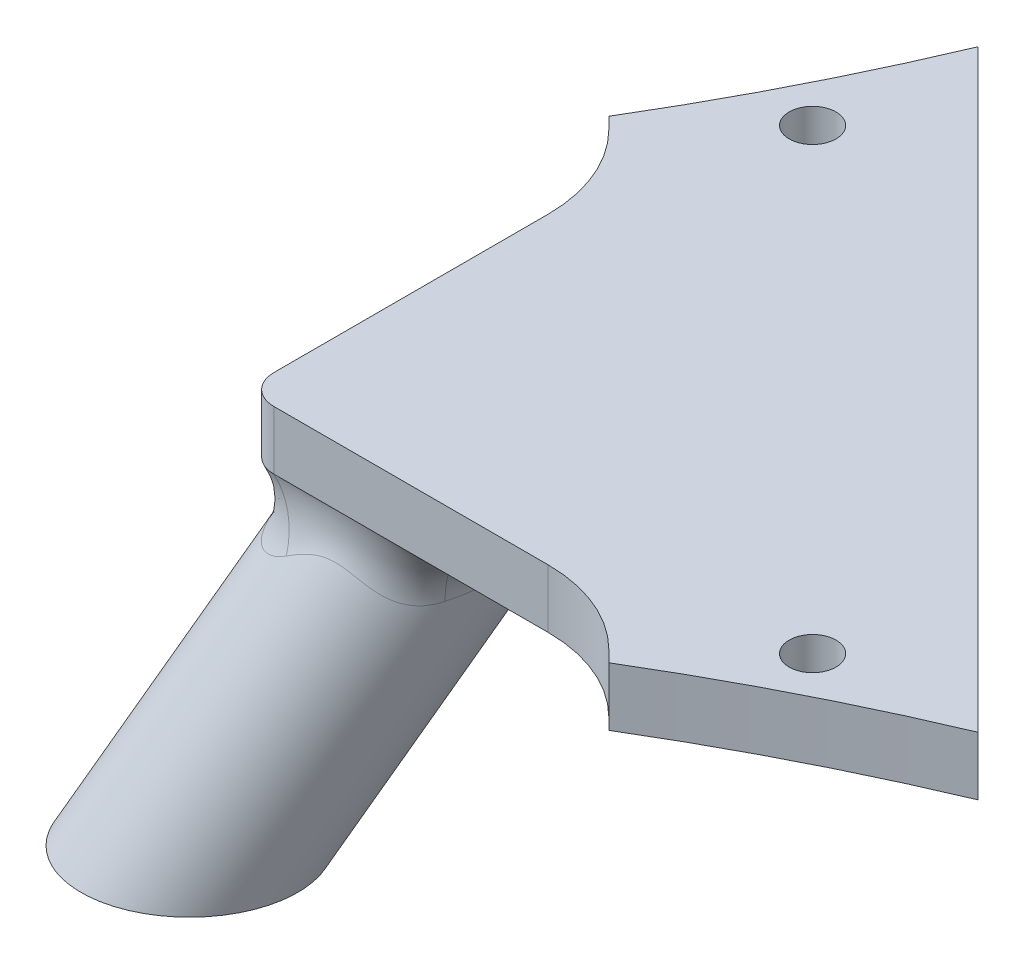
ISO-10303-21;
HEADER;
FILE_DESCRIPTION(('STEP AP214'),'2;1');
FILE_NAME('part.step','',(''),(''),'','','');
FILE_SCHEMA(('AUTOMOTIVE_DESIGN { 1 0 10303 214 1 1 1 1 }'));
ENDSEC;
DATA;
#1=APPLICATION_CONTEXT('core data for automotive mechanical design processes');
#2=APPLICATION_PROTOCOL_DEFINITION('international standard','automotive_design',2000,#1);
#3=PRODUCT_CONTEXT('',#1,'mechanical');
#4=PRODUCT('Part','Part','',(#3));
#5=PRODUCT_RELATED_PRODUCT_CATEGORY('part','',(#4));
#6=PRODUCT_DEFINITION_FORMATION('','',#4);
#7=PRODUCT_DEFINITION_CONTEXT('part definition',#1,'design');
#8=PRODUCT_DEFINITION('design','',#6,#7);
#9=PRODUCT_DEFINITION_SHAPE('','',#8);
#10=(LENGTH_UNIT() NAMED_UNIT(*) SI_UNIT(.MILLI.,.METRE.));
#11=(NAMED_UNIT(*) PLANE_ANGLE_UNIT() SI_UNIT($,.RADIAN.));
#12=(NAMED_UNIT(*) SI_UNIT($,.STERADIAN.) SOLID_ANGLE_UNIT());
#13=UNCERTAINTY_MEASURE_WITH_UNIT(LENGTH_MEASURE(1.E-05),#10,'distance_accuracy_value','');
#14=(GEOMETRIC_REPRESENTATION_CONTEXT(3) GLOBAL_UNCERTAINTY_ASSIGNED_CONTEXT((#13)) GLOBAL_UNIT_ASSIGNED_CONTEXT((#10,
#11,#12)) REPRESENTATION_CONTEXT('',''));
#15=CARTESIAN_POINT('',(0.,0.,0.));
#16=DIRECTION('',(0.,0.,1.));
#17=DIRECTION('',(1.,0.,0.));
#18=AXIS2_PLACEMENT_3D('',#15,#16,#17);
#19=CARTESIAN_POINT('',(0.,4.,0.));
#20=DIRECTION('',(0.,1.,0.));
#21=DIRECTION('',(0.,0.,1.));
#22=AXIS2_PLACEMENT_3D('',#19,#20,#21);
#23=PLANE('',#22);
#24=DIRECTION('',(0.707106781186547,0.,0.707106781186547));
#25=VECTOR('',#24,1.);
#26=CARTESIAN_POINT('',(-18.7683417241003,4.,-28.6587054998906));
#27=LINE('',#26,#25);
#28=CARTESIAN_POINT('',(-11.2223546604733,4.,-21.1127184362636));
#29=VERTEX_POINT('',#28);
#30=CARTESIAN_POINT('',(-10.4289321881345,4.,-20.3192959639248));
#31=VERTEX_POINT('',#30);
#32=EDGE_CURVE('E146',#29,#31,#27,.T.);
#33=ORIENTED_EDGE('',*,*,#32,.T.);
#34=CARTESIAN_POINT('',(-17.5,4.,-13.2482281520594));
#35=DIRECTION('',(0.,1.,0.));
#36=DIRECTION('',(0.,0.,1.));
#37=AXIS2_PLACEMENT_3D('',#34,#35,#36);
#38=CIRCLE('',#37,10.);
#39=CARTESIAN_POINT('',(-7.49999999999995,4.,-13.2482281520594));
#40=VERTEX_POINT('',#39);
#41=EDGE_CURVE('E11',#31,#40,#38,.F.);
#42=ORIENTED_EDGE('',*,*,#41,.T.);
#43=DIRECTION('',(0.,0.,1.));
#44=VECTOR('',#43,1.);
#45=CARTESIAN_POINT('',(-7.49999999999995,4.,7.50000000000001));
#46=LINE('',#45,#44);
#47=CARTESIAN_POINT('',(-7.49999999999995,4.,5.50000000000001));
#48=VERTEX_POINT('',#47);
#49=EDGE_CURVE('E539',#40,#48,#46,.T.);
#50=ORIENTED_EDGE('',*,*,#49,.T.);
#51=CARTESIAN_POINT('',(-5.49999999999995,4.,5.50000000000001));
#52=DIRECTION('',(0.,1.,0.));
#53=DIRECTION('',(0.,0.,1.));
#54=AXIS2_PLACEMENT_3D('',#51,#52,#53);
#55=CIRCLE('',#54,2.);
#56=CARTESIAN_POINT('',(-5.49999999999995,4.,7.50000000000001));
#57=VERTEX_POINT('',#56);
#58=EDGE_CURVE('E186',#48,#57,#55,.T.);
#59=ORIENTED_EDGE('',*,*,#58,.T.);
#60=DIRECTION('',(1.,0.,0.));
#61=VECTOR('',#60,1.);
#62=CARTESIAN_POINT('',(17.3903637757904,4.,7.50000000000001));
#63=LINE('',#62,#61);
#64=CARTESIAN_POINT('',(13.2482281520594,4.,7.50000000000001));
#65=VERTEX_POINT('',#64);
#66=EDGE_CURVE('E142',#57,#65,#63,.T.);
#67=ORIENTED_EDGE('',*,*,#66,.T.);
#68=CARTESIAN_POINT('',(13.2482281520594,4.,17.5));
#69=DIRECTION('',(0.,1.,0.));
#70=DIRECTION('',(0.,0.,1.));
#71=AXIS2_PLACEMENT_3D('',#68,#69,#70);
#72=CIRCLE('',#71,10.);
#73=CARTESIAN_POINT('',(20.3192959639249,4.,10.4289321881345));
#74=VERTEX_POINT('',#73);
#75=EDGE_CURVE('E356',#65,#74,#72,.F.);
#76=ORIENTED_EDGE('',*,*,#75,.T.);
#77=DIRECTION('',(0.707106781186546,0.,0.707106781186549));
#78=VECTOR('',#77,1.);
#79=CARTESIAN_POINT('',(17.3903637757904,4.,7.50000000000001));
#80=LINE('',#79,#78);
#81=CARTESIAN_POINT('',(21.1127184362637,4.,11.2223546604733));
#82=VERTEX_POINT('',#81);
#83=EDGE_CURVE('E164',#74,#82,#80,.T.);
#84=ORIENTED_EDGE('',*,*,#83,.T.);
#85=CARTESIAN_POINT('',(88.6781925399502,4.,123.453841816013));
#86=DIRECTION('',(0.,1.,0.));
#87=DIRECTION('',(0.,0.,1.));
#88=AXIS2_PLACEMENT_3D('',#85,#86,#87);
#89=CIRCLE('',#88,131.);
#90=CARTESIAN_POINT('',(37.8332387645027,4.,2.72360254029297));
#91=VERTEX_POINT('',#90);
#92=EDGE_CURVE('E544',#91,#82,#89,.T.);
#93=ORIENTED_EDGE('',*,*,#92,.F.);
#94=DIRECTION('',(-0.707106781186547,0.,-0.707106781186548));
#95=VECTOR('',#94,1.);
#96=CARTESIAN_POINT('',(-6.15870549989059,4.,-41.2683417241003));
#97=LINE('',#96,#95);
#98=CARTESIAN_POINT('',(-2.72360254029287,4.,-37.8332387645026));
#99=VERTEX_POINT('',#98);
#100=EDGE_CURVE('E365',#91,#99,#97,.T.);
#101=ORIENTED_EDGE('',*,*,#100,.T.);
#102=CARTESIAN_POINT('',(-123.453841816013,4.,-88.6781925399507));
#103=DIRECTION('',(0.,1.,0.));
#104=DIRECTION('',(0.,0.,1.));
#105=AXIS2_PLACEMENT_3D('',#102,#103,#104);
#106=CIRCLE('',#105,131.);
#107=EDGE_CURVE('E550',#29,#99,#106,.T.);
#108=ORIENTED_EDGE('',*,*,#107,.F.);
#109=EDGE_LOOP('',(#33,#42,#50,#59,#67,#76,#84,#93,#101,#108));
#110=FACE_BOUND('',#109,.T.);
#111=CARTESIAN_POINT('',(-3.72049067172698,4.,-27.5290214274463));
#112=DIRECTION('',(0.,1.,0.));
#113=DIRECTION('',(0.,0.,1.));
#114=AXIS2_PLACEMENT_3D('',#111,#112,#113);
#115=CIRCLE('',#114,1.59999999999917);
#116=CARTESIAN_POINT('',(-3.72049067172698,4.,-25.9290214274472));
#117=VERTEX_POINT('',#116);
#118=EDGE_CURVE('E172',#117,#117,#115,.T.);
#119=ORIENTED_EDGE('',*,*,#118,.F.);
#120=EDGE_LOOP('',(#119));
#121=FACE_BOUND('',#120,.T.);
#122=CARTESIAN_POINT('',(27.5290214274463,4.,3.72049067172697));
#123=DIRECTION('',(0.,1.,0.));
#124=DIRECTION('',(0.,0.,-1.));
#125=AXIS2_PLACEMENT_3D('',#122,#123,#124);
#126=CIRCLE('',#125,1.59999999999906);
#127=CARTESIAN_POINT('',(27.5290214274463,4.,2.1204906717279));
#128=VERTEX_POINT('',#127);
#129=EDGE_CURVE('E556',#128,#128,#126,.T.);
#130=ORIENTED_EDGE('',*,*,#129,.F.);
#131=EDGE_LOOP('',(#130));
#132=FACE_BOUND('',#131,.T.);
#133=ADVANCED_FACE('F38',(#110,#121,#132),#23,.T.);
#134=CARTESIAN_POINT('',(17.3903637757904,4.,7.50000000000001));
#135=DIRECTION('',(0.707106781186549,0.,-0.707106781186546));
#136=DIRECTION('',(-0.707106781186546,0.,-0.707106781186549));
#137=AXIS2_PLACEMENT_3D('',#134,#135,#136);
#138=PLANE('',#137);
#139=ORIENTED_EDGE('',*,*,#83,.F.);
#140=DIRECTION('',(0.,-1.,0.));
#141=VECTOR('',#140,1.);
#142=CARTESIAN_POINT('',(20.3192959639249,0.,10.4289321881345));
#143=LINE('',#142,#141);
#144=CARTESIAN_POINT('',(20.3192959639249,0.,10.4289321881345));
#145=VERTEX_POINT('',#144);
#146=EDGE_CURVE('E341',#74,#145,#143,.T.);
#147=ORIENTED_EDGE('',*,*,#146,.T.);
#148=DIRECTION('',(0.707106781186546,0.,0.707106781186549));
#149=VECTOR('',#148,1.);
#150=CARTESIAN_POINT('',(17.3903637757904,0.,7.50000000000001));
#151=LINE('',#150,#149);
#152=CARTESIAN_POINT('',(21.1127184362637,0.,11.2223546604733));
#153=VERTEX_POINT('',#152);
#154=EDGE_CURVE('E156',#145,#153,#151,.T.);
#155=ORIENTED_EDGE('',*,*,#154,.T.);
#156=DIRECTION('',(0.,1.,0.));
#157=VECTOR('',#156,1.);
#158=CARTESIAN_POINT('',(21.1127184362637,-41.,11.2223546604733));
#159=LINE('',#158,#157);
#160=EDGE_CURVE('E364',#153,#82,#159,.T.);
#161=ORIENTED_EDGE('',*,*,#160,.T.);
#162=EDGE_LOOP('',(#139,#147,#155,#161));
#163=FACE_BOUND('',#162,.T.);
#164=ADVANCED_FACE('F258',(#163),#138,.F.);
#165=CARTESIAN_POINT('',(-6.15870549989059,4.,-41.2683417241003));
#166=DIRECTION('',(-0.707106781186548,0.,0.707106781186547));
#167=DIRECTION('',(0.707106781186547,0.,0.707106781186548));
#168=AXIS2_PLACEMENT_3D('',#165,#166,#167);
#169=PLANE('',#168);
#170=ORIENTED_EDGE('',*,*,#100,.F.);
#171=DIRECTION('',(0.,1.,0.));
#172=VECTOR('',#171,1.);
#173=CARTESIAN_POINT('',(37.8332387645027,-41.,2.72360254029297));
#174=LINE('',#173,#172);
#175=CARTESIAN_POINT('',(37.8332387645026,0.,2.72360254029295));
#176=VERTEX_POINT('',#175);
#177=EDGE_CURVE('E545',#91,#176,#174,.F.);
#178=ORIENTED_EDGE('',*,*,#177,.T.);
#179=DIRECTION('',(-0.707106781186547,0.,-0.707106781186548));
#180=VECTOR('',#179,1.);
#181=CARTESIAN_POINT('',(-6.15870549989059,0.,-41.2683417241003));
#182=LINE('',#181,#180);
#183=CARTESIAN_POINT('',(-2.72360254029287,0.,-37.8332387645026));
#184=VERTEX_POINT('',#183);
#185=EDGE_CURVE('E152',#176,#184,#182,.T.);
#186=ORIENTED_EDGE('',*,*,#185,.T.);
#187=DIRECTION('',(0.,1.,0.));
#188=VECTOR('',#187,1.);
#189=CARTESIAN_POINT('',(-2.72360254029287,-41.,-37.8332387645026));
#190=LINE('',#189,#188);
#191=EDGE_CURVE('E138',#184,#99,#190,.T.);
#192=ORIENTED_EDGE('',*,*,#191,.T.);
#193=EDGE_LOOP('',(#170,#178,#186,#192));
#194=FACE_BOUND('',#193,.T.);
#195=ADVANCED_FACE('F263',(#194),#169,.F.);
#196=CARTESIAN_POINT('',(-18.7683417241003,4.,-28.6587054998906));
#197=DIRECTION('',(0.707106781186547,0.,-0.707106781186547));
#198=DIRECTION('',(-0.707106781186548,0.,-0.707106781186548));
#199=AXIS2_PLACEMENT_3D('',#196,#197,#198);
#200=PLANE('',#199);
#201=DIRECTION('',(0.707106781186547,0.,0.707106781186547));
#202=VECTOR('',#201,1.);
#203=CARTESIAN_POINT('',(-18.7683417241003,0.,-28.6587054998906));
#204=LINE('',#203,#202);
#205=CARTESIAN_POINT('',(-11.2223546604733,0.,-21.1127184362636));
#206=VERTEX_POINT('',#205);
#207=CARTESIAN_POINT('',(-10.4289321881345,0.,-20.3192959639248));
#208=VERTEX_POINT('',#207);
#209=EDGE_CURVE('E145',#206,#208,#204,.T.);
#210=ORIENTED_EDGE('',*,*,#209,.T.);
#211=DIRECTION('',(0.,-1.,0.));
#212=VECTOR('',#211,1.);
#213=CARTESIAN_POINT('',(-10.4289321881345,4.,-20.3192959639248));
#214=LINE('',#213,#212);
#215=EDGE_CURVE('E59',#208,#31,#214,.F.);
#216=ORIENTED_EDGE('',*,*,#215,.T.);
#217=ORIENTED_EDGE('',*,*,#32,.F.);
#218=DIRECTION('',(0.,1.,0.));
#219=VECTOR('',#218,1.);
#220=CARTESIAN_POINT('',(-11.2223546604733,-41.,-21.1127184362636));
#221=LINE('',#220,#219);
#222=EDGE_CURVE('E135',#29,#206,#221,.F.);
#223=ORIENTED_EDGE('',*,*,#222,.T.);
#224=EDGE_LOOP('',(#210,#216,#217,#223));
#225=FACE_BOUND('',#224,.T.);
#226=ADVANCED_FACE('F144',(#225),#200,.F.);
#227=CARTESIAN_POINT('',(-7.49999999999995,4.,7.50000000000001));
#228=DIRECTION('',(1.,0.,0.));
#229=DIRECTION('',(0.,0.,-1.));
#230=AXIS2_PLACEMENT_3D('',#227,#228,#229);
#231=PLANE('',#230);
#232=ORIENTED_EDGE('',*,*,#49,.F.);
#233=DIRECTION('',(0.,-1.,0.));
#234=VECTOR('',#233,1.);
#235=CARTESIAN_POINT('',(-7.49999999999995,0.,-13.2482281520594));
#236=LINE('',#235,#234);
#237=CARTESIAN_POINT('',(-7.49999999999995,0.,-13.2482281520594));
#238=VERTEX_POINT('',#237);
#239=EDGE_CURVE('E348',#40,#238,#236,.T.);
#240=ORIENTED_EDGE('',*,*,#239,.T.);
#241=DIRECTION('',(0.,0.,1.));
#242=VECTOR('',#241,1.);
#243=CARTESIAN_POINT('',(-7.49999999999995,0.,7.50000000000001));
#244=LINE('',#243,#242);
#245=CARTESIAN_POINT('',(-7.49999999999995,0.,-7.62382904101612));
#246=VERTEX_POINT('',#245);
#247=EDGE_CURVE('E154',#238,#246,#244,.T.);
#248=ORIENTED_EDGE('',*,*,#247,.T.);
#249=CARTESIAN_POINT('',(-7.49999999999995,0.,5.50000000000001));
#250=VERTEX_POINT('',#249);
#251=EDGE_CURVE('E151',#246,#250,#244,.T.);
#252=ORIENTED_EDGE('',*,*,#251,.T.);
#253=DIRECTION('',(0.,-1.,0.));
#254=VECTOR('',#253,1.);
#255=CARTESIAN_POINT('',(-7.49999999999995,4.,5.50000000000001));
#256=LINE('',#255,#254);
#257=EDGE_CURVE('E183',#250,#48,#256,.F.);
#258=ORIENTED_EDGE('',*,*,#257,.T.);
#259=EDGE_LOOP('',(#232,#240,#248,#252,#258));
#260=FACE_BOUND('',#259,.T.);
#261=ADVANCED_FACE('F425',(#260),#231,.F.);
#262=CARTESIAN_POINT('',(17.3903637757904,4.,7.50000000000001));
#263=DIRECTION('',(0.,0.,-1.));
#264=DIRECTION('',(-1.,0.,0.));
#265=AXIS2_PLACEMENT_3D('',#262,#263,#264);
#266=PLANE('',#265);
#267=DIRECTION('',(1.,0.,0.));
#268=VECTOR('',#267,1.);
#269=CARTESIAN_POINT('',(17.3903637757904,0.,7.50000000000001));
#270=LINE('',#269,#268);
#271=CARTESIAN_POINT('',(7.62382904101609,0.,7.50000000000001));
#272=VERTEX_POINT('',#271);
#273=CARTESIAN_POINT('',(13.2482281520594,0.,7.50000000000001));
#274=VERTEX_POINT('',#273);
#275=EDGE_CURVE('E160',#272,#274,#270,.T.);
#276=ORIENTED_EDGE('',*,*,#275,.T.);
#277=DIRECTION('',(0.,-1.,0.));
#278=VECTOR('',#277,1.);
#279=CARTESIAN_POINT('',(13.2482281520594,4.,7.50000000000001));
#280=LINE('',#279,#278);
#281=EDGE_CURVE('E344',#274,#65,#280,.F.);
#282=ORIENTED_EDGE('',*,*,#281,.T.);
#283=ORIENTED_EDGE('',*,*,#66,.F.);
#284=DIRECTION('',(0.,-1.,0.));
#285=VECTOR('',#284,1.);
#286=CARTESIAN_POINT('',(-5.49999999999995,4.,7.50000000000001));
#287=LINE('',#286,#285);
#288=CARTESIAN_POINT('',(-5.49999999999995,0.,7.50000000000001));
#289=VERTEX_POINT('',#288);
#290=EDGE_CURVE('E177',#57,#289,#287,.T.);
#291=ORIENTED_EDGE('',*,*,#290,.T.);
#292=EDGE_CURVE('E161',#289,#272,#270,.T.);
#293=ORIENTED_EDGE('',*,*,#292,.T.);
#294=EDGE_LOOP('',(#276,#282,#283,#291,#293));
#295=FACE_BOUND('',#294,.T.);
#296=ADVANCED_FACE('F269',(#295),#266,.F.);
#297=CARTESIAN_POINT('',(0.,0.,0.));
#298=DIRECTION('',(0.,1.,0.));
#299=DIRECTION('',(0.,0.,1.));
#300=AXIS2_PLACEMENT_3D('',#297,#298,#299);
#301=PLANE('',#300);
#302=CARTESIAN_POINT('',(-3.72049067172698,0.,-27.5290214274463));
#303=DIRECTION('',(0.,1.,0.));
#304=DIRECTION('',(0.,0.,1.));
#305=AXIS2_PLACEMENT_3D('',#302,#303,#304);
#306=CIRCLE('',#305,1.59999999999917);
#307=CARTESIAN_POINT('',(-3.72049067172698,0.,-25.9290214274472));
#308=VERTEX_POINT('',#307);
#309=EDGE_CURVE('E168',#308,#308,#306,.T.);
#310=ORIENTED_EDGE('',*,*,#309,.T.);
#311=EDGE_LOOP('',(#310));
#312=FACE_BOUND('',#311,.T.);
#313=CARTESIAN_POINT('',(27.5290214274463,0.,3.72049067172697));
#314=DIRECTION('',(0.,1.,0.));
#315=DIRECTION('',(0.,0.,1.));
#316=AXIS2_PLACEMENT_3D('',#313,#314,#315);
#317=CIRCLE('',#316,1.59999999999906);
#318=CARTESIAN_POINT('',(27.5290214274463,0.,5.32049067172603));
#319=VERTEX_POINT('',#318);
#320=EDGE_CURVE('E169',#319,#319,#317,.T.);
#321=ORIENTED_EDGE('',*,*,#320,.T.);
#322=EDGE_LOOP('',(#321));
#323=FACE_BOUND('',#322,.T.);
#324=ORIENTED_EDGE('',*,*,#275,.F.);
#325=CARTESIAN_POINT('',(-2.04124145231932,0.,2.04124145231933));
#326=DIRECTION('',(0.,1.,0.));
#327=DIRECTION('',(0.707106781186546,0.,-0.707106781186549));
#328=AXIS2_PLACEMENT_3D('',#325,#326,#327);
#329=ELLIPSE('',#328,12.7017059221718,11.);
#330=EDGE_CURVE('E339',#272,#246,#329,.T.);
#331=ORIENTED_EDGE('',*,*,#330,.T.);
#332=ORIENTED_EDGE('',*,*,#247,.F.);
#333=CARTESIAN_POINT('',(-17.5,0.,-13.2482281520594));
#334=DIRECTION('',(0.,1.,0.));
#335=DIRECTION('',(0.,0.,1.));
#336=AXIS2_PLACEMENT_3D('',#333,#334,#335);
#337=CIRCLE('',#336,10.);
#338=EDGE_CURVE('E46',#238,#208,#337,.T.);
#339=ORIENTED_EDGE('',*,*,#338,.T.);
#340=ORIENTED_EDGE('',*,*,#209,.F.);
#341=CARTESIAN_POINT('',(-123.453841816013,0.,-88.6781925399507));
#342=DIRECTION('',(0.,1.,0.));
#343=DIRECTION('',(0.,0.,1.));
#344=AXIS2_PLACEMENT_3D('',#341,#342,#343);
#345=CIRCLE('',#344,131.);
#346=EDGE_CURVE('E132',#206,#184,#345,.T.);
#347=ORIENTED_EDGE('',*,*,#346,.T.);
#348=ORIENTED_EDGE('',*,*,#185,.F.);
#349=CARTESIAN_POINT('',(88.6781925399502,0.,123.453841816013));
#350=DIRECTION('',(0.,1.,0.));
#351=DIRECTION('',(0.,0.,1.));
#352=AXIS2_PLACEMENT_3D('',#349,#350,#351);
#353=CIRCLE('',#352,131.);
#354=EDGE_CURVE('E141',#176,#153,#353,.T.);
#355=ORIENTED_EDGE('',*,*,#354,.T.);
#356=ORIENTED_EDGE('',*,*,#154,.F.);
#357=CARTESIAN_POINT('',(13.2482281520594,0.,17.5));
#358=DIRECTION('',(0.,1.,0.));
#359=DIRECTION('',(0.,0.,1.));
#360=AXIS2_PLACEMENT_3D('',#357,#358,#359);
#361=CIRCLE('',#360,10.);
#362=EDGE_CURVE('E354',#145,#274,#361,.T.);
#363=ORIENTED_EDGE('',*,*,#362,.T.);
#364=EDGE_LOOP('',(#324,#331,#332,#339,#340,#347,#348,#355,#356,#363));
#365=FACE_BOUND('',#364,.T.);
#366=ADVANCED_FACE('F150',(#312,#323,#365),#301,.F.);
#367=CARTESIAN_POINT('',(-10.6066017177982,-25.9807621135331,10.6066017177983));
#368=DIRECTION('',(0.353553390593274,0.866025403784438,-0.353553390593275));
#369=DIRECTION('',(0.,0.377964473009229,0.925820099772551));
#370=AXIS2_PLACEMENT_3D('',#367,#368,#369);
#371=CYLINDRICAL_SURFACE('',#370,6.);
#372=CARTESIAN_POINT('',(-9.38185684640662,-22.9807621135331,9.38185684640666));
#373=DIRECTION('',(0.,1.,0.));
#374=DIRECTION('',(0.707106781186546,0.,-0.707106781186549));
#375=AXIS2_PLACEMENT_3D('',#372,#373,#374);
#376=ELLIPSE('',#375,6.92820323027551,6.);
#377=CARTESIAN_POINT('',(-4.48287736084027,-22.9807621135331,4.48287736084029));
#378=VERTEX_POINT('',#377);
#379=EDGE_CURVE('E241',#378,#378,#376,.T.);
#380=ORIENTED_EDGE('',*,*,#379,.T.);
#381=EDGE_LOOP('',(#380));
#382=FACE_BOUND('',#381,.T.);
#383=CARTESIAN_POINT('',(-2.04124145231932,-5.,2.04124145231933));
#384=DIRECTION('',(0.202333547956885,-0.95818697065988,-0.202333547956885));
#385=DIRECTION('',(0.677540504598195,0.286142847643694,-0.677540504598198));
#386=AXIS2_PLACEMENT_3D('',#383,#384,#385);
#387=ELLIPSE('',#386,8.73689494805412,6.);
#388=CARTESIAN_POINT('',(-4.77975111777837,-4.41458420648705,-3.46961017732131));
#389=VERTEX_POINT('',#388);
#390=CARTESIAN_POINT('',(3.46961017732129,-4.41458420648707,4.77975111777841));
#391=VERTEX_POINT('',#390);
#392=EDGE_CURVE('E188',#389,#391,#387,.T.);
#393=ORIENTED_EDGE('',*,*,#392,.T.);
#394=CARTESIAN_POINT('',(4.31427299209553,-3.6544907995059,3.51182347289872));
#395=CARTESIAN_POINT('',(4.40048160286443,0.857728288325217,5.42559598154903));
#396=CARTESIAN_POINT('',(8.75837425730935,0.,7.50000000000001));
#397=CARTESIAN_POINT('',(4.25137826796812,-3.73602630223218,3.60845949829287));
#398=CARTESIAN_POINT('',(4.36370214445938,0.800436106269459,5.3871765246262));
#399=CARTESIAN_POINT('',(8.68048925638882,0.,7.50000000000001));
#400=CARTESIAN_POINT('',(4.18843594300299,-3.81209958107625,3.70541144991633));
#401=CARTESIAN_POINT('',(4.32660156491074,0.741204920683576,5.35026632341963));
#402=CARTESIAN_POINT('',(8.6011611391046,0.,7.50000000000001));
#403=CARTESIAN_POINT('',(4.06239328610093,-3.95317995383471,3.89901980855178));
#404=CARTESIAN_POINT('',(4.25223397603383,0.619347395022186,5.28103063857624));
#405=CARTESIAN_POINT('',(8.43937730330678,0.,7.50000000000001));
#406=CARTESIAN_POINT('',(3.99929303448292,-4.01819183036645,3.99567632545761));
#407=CARTESIAN_POINT('',(4.21498168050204,0.556765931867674,5.24868733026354));
#408=CARTESIAN_POINT('',(8.35692295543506,0.,7.50000000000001));
#409=CARTESIAN_POINT('',(3.87309265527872,-4.13681975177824,4.18743341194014));
#410=CARTESIAN_POINT('',(4.14074007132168,0.428700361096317,5.18996133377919));
#411=CARTESIAN_POINT('',(8.18894469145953,0.,7.50000000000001));
#412=CARTESIAN_POINT('',(3.8099937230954,-4.19048417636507,4.28253892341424));
#413=CARTESIAN_POINT('',(4.10376994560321,0.363285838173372,5.16353128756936));
#414=CARTESIAN_POINT('',(8.1034357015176,0.,7.50000000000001));
#415=CARTESIAN_POINT('',(3.68342798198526,-4.28688920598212,4.47082237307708));
#416=CARTESIAN_POINT('',(4.02982115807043,0.230000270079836,5.1177604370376));
#417=CARTESIAN_POINT('',(7.92879354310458,0.,7.50000000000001));
#418=CARTESIAN_POINT('',(3.61996113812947,-4.32962875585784,4.56400012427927));
#419=CARTESIAN_POINT('',(3.99286542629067,0.162187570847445,5.09838437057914));
#420=CARTESIAN_POINT('',(7.83966002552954,0.,7.50000000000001));
#421=CARTESIAN_POINT('',(3.48917820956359,-4.40643392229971,4.752587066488));
#422=CARTESIAN_POINT('',(3.91663272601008,0.0215335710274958,5.06704494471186));
#423=CARTESIAN_POINT('',(7.65275625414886,0.,7.50000000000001));
#424=CARTESIAN_POINT('',(3.42183725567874,-4.43991583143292,4.8478505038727));
#425=CARTESIAN_POINT('',(3.87735228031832,-0.0513484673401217,5.05546522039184));
#426=CARTESIAN_POINT('',(7.55477887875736,0.,7.50000000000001));
#427=CARTESIAN_POINT('',(3.28656064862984,-4.49554572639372,5.03468555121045));
#428=CARTESIAN_POINT('',(3.79772689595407,-0.197084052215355,5.04229791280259));
#429=CARTESIAN_POINT('',(7.35451931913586,0.,7.50000000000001));
#430=CARTESIAN_POINT('',(3.21862478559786,-4.51768953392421,5.1262557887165));
#431=CARTESIAN_POINT('',(3.7574204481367,-0.269883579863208,5.0406321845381));
#432=CARTESIAN_POINT('',(7.25223556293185,0.,7.50000000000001));
#433=CARTESIAN_POINT('',(3.0137467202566,-4.5680349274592,5.39451480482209));
#434=CARTESIAN_POINT('',(3.63421464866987,-0.48463916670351,5.05130491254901));
#435=CARTESIAN_POINT('',(6.93875677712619,0.,7.50000000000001));
#436=CARTESIAN_POINT('',(2.87573046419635,-4.5801525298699,5.56475713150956));
#437=CARTESIAN_POINT('',(3.54815597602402,-0.624760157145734,5.07880788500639));
#438=CARTESIAN_POINT('',(6.72092911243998,0.,7.50000000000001));
#439=CARTESIAN_POINT('',(2.58240469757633,-4.56730259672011,5.90040570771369));
#440=CARTESIAN_POINT('',(3.35201676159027,-0.896642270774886,5.17701243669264));
#441=CARTESIAN_POINT('',(6.24540464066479,0.,7.50000000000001));
#442=CARTESIAN_POINT('',(2.42676339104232,-4.53844022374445,6.06356137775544));
#443=CARTESIAN_POINT('',(3.24077378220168,-1.02663854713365,5.25082229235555));
#444=CARTESIAN_POINT('',(5.98590587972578,0.,7.50000000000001));
#445=CARTESIAN_POINT('',(2.11101481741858,-4.4466583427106,6.36248947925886));
#446=CARTESIAN_POINT('',(2.9931314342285,-1.24863949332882,5.43011970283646));
#447=CARTESIAN_POINT('',(5.44764369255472,0.,7.50000000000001));
#448=CARTESIAN_POINT('',(1.95090567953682,-4.38372435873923,6.4982502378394));
#449=CARTESIAN_POINT('',(2.85741073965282,-1.34140685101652,5.53481097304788));
#450=CARTESIAN_POINT('',(5.16887212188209,0.,7.50000000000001));
#451=CARTESIAN_POINT('',(1.66879473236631,-4.25422955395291,6.71010948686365));
#452=CARTESIAN_POINT('',(2.59681275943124,-1.46751629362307,5.72842486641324));
#453=CARTESIAN_POINT('',(4.67008267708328,0.,7.50000000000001));
#454=CARTESIAN_POINT('',(1.54795008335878,-4.19305882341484,6.79248153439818));
#455=CARTESIAN_POINT('',(2.47944749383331,-1.51026147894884,5.81362241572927));
#456=CARTESIAN_POINT('',(4.45409453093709,0.,7.50000000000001));
#457=CARTESIAN_POINT('',(1.30297316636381,-4.06223211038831,6.94327278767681));
#458=CARTESIAN_POINT('',(2.22932167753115,-1.57582765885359,5.98466273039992));
#459=CARTESIAN_POINT('',(4.01281492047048,0.,7.50000000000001));
#460=CARTESIAN_POINT('',(1.17883955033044,-3.9925726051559,7.0116861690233));
#461=CARTESIAN_POINT('',(2.09669437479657,-1.5989788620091,6.07056498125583));
#462=CARTESIAN_POINT('',(3.78751961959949,0.,7.50000000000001));
#463=CARTESIAN_POINT('',(0.926291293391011,-3.8488795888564,7.13571760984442));
#464=CARTESIAN_POINT('',(1.81583462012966,-1.62858188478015,6.23797992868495));
#465=CARTESIAN_POINT('',(3.32707751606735,0.,7.50000000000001));
#466=CARTESIAN_POINT('',(0.797863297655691,-3.7748317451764,7.19129046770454));
#467=CARTESIAN_POINT('',(1.66758910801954,-1.6352362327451,6.31965054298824));
#468=CARTESIAN_POINT('',(3.09189925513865,0.,7.50000000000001));
#469=CARTESIAN_POINT('',(0.536272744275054,-3.62726918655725,7.29068450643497));
#470=CARTESIAN_POINT('',(1.35629165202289,-1.63603660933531,6.47426336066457));
#471=CARTESIAN_POINT('',(2.61226778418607,0.,7.50000000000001));
#472=CARTESIAN_POINT('',(0.403111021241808,-3.55375438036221,7.33450774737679));
#473=CARTESIAN_POINT('',(1.1931864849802,-1.6303443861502,6.54743915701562));
#474=CARTESIAN_POINT('',(2.36781620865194,0.,7.50000000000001));
#475=CARTESIAN_POINT('',(0.150752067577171,-3.42283568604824,7.40645253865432));
#476=CARTESIAN_POINT('',(0.877157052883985,-1.61292359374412,6.67255499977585));
#477=CARTESIAN_POINT('',(1.90553518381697,0.,7.50000000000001));
#478=CARTESIAN_POINT('',(0.0323497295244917,-3.36464562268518,7.43593184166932));
#479=CARTESIAN_POINT('',(0.726319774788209,-1.60225047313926,6.72612120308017));
#480=CARTESIAN_POINT('',(1.68902107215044,0.,7.50000000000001));
#481=CARTESIAN_POINT('',(-0.209596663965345,-3.25629341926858,7.48885242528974));
#482=CARTESIAN_POINT('',(0.414340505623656,-1.57903309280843,6.82374461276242));
#483=CARTESIAN_POINT('',(1.24852136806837,0.,7.50000000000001));
#484=CARTESIAN_POINT('',(-0.333140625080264,-3.20613113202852,7.51229381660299));
#485=CARTESIAN_POINT('',(0.253035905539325,-1.56648523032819,6.86795070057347));
#486=CARTESIAN_POINT('',(1.02453591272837,0.,7.50000000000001));
#487=CARTESIAN_POINT('',(-0.585157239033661,-3.11844554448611,7.55445437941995));
#488=CARTESIAN_POINT('',(-0.0781481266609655,-1.54331977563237,6.9457920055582));
#489=CARTESIAN_POINT('',(0.570775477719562,0.,7.50000000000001));
#490=CARTESIAN_POINT('',(-0.713582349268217,-3.08082398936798,7.57320995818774));
#491=CARTESIAN_POINT('',(-0.248164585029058,-1.53265753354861,6.97963386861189));
#492=CARTESIAN_POINT('',(0.341061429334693,0.,7.50000000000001));
#493=CARTESIAN_POINT('',(-0.976733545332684,-3.02198820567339,7.6078138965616));
#494=CARTESIAN_POINT('',(-0.597004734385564,-1.51672895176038,7.03680022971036));
#495=CARTESIAN_POINT('',(-0.125378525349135,0.,7.50000000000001));
#496=CARTESIAN_POINT('',(-1.11145813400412,-3.0007700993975,7.6236629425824));
#497=CARTESIAN_POINT('',(-0.776117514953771,-1.51142423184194,7.06022404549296));
#498=CARTESIAN_POINT('',(-0.362102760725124,0.,7.50000000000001));
#499=CARTESIAN_POINT('',(-1.38847419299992,-2.97823640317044,7.65409341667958));
#500=CARTESIAN_POINT('',(-1.14328757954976,-1.50921356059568,7.09657478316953));
#501=CARTESIAN_POINT('',(-0.843689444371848,0.,7.50000000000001));
#502=CARTESIAN_POINT('',(-1.5308302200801,-2.97713194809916,7.66865980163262));
#503=CARTESIAN_POINT('',(-1.33178851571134,-1.51237552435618,7.10945057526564));
#504=CARTESIAN_POINT('',(-1.08861121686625,0.,7.50000000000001));
#505=CARTESIAN_POINT('',(-1.82062064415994,-2.99714026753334,7.69739032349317));
#506=CARTESIAN_POINT('',(-1.71302398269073,-1.5290481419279,7.12429699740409));
#507=CARTESIAN_POINT('',(-1.58160916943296,0.,7.50000000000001));
#508=CARTESIAN_POINT('',(-1.96805468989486,-3.01825150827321,7.71155448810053));
#509=CARTESIAN_POINT('',(-1.90617118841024,-1.54257567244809,7.12628497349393));
#510=CARTESIAN_POINT('',(-1.82968513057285,0.,7.50000000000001));
#511=CARTESIAN_POINT('',(-2.26808637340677,-3.08218108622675,7.73997635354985));
#512=CARTESIAN_POINT('',(-2.295752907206,-1.58016952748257,7.11942797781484));
#513=CARTESIAN_POINT('',(-2.32921734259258,0.,7.50000000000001));
#514=CARTESIAN_POINT('',(-2.42072552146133,-3.12526749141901,7.75423301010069));
#515=CARTESIAN_POINT('',(-2.49262899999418,-1.60442955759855,7.11041595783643));
#516=CARTESIAN_POINT('',(-2.58067708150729,0.,7.50000000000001));
#517=CARTESIAN_POINT('',(-2.72759338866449,-3.23021464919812,7.78228343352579));
#518=CARTESIAN_POINT('',(-2.88421892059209,-1.66193111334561,7.08141731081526));
#519=CARTESIAN_POINT('',(-3.08160303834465,0.,7.50000000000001));
#520=CARTESIAN_POINT('',(-2.88182270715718,-3.29208275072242,7.79607701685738));
#521=CARTESIAN_POINT('',(-3.07934623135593,-1.69527772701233,7.061346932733));
#522=CARTESIAN_POINT('',(-3.33106843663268,0.,7.50000000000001));
#523=CARTESIAN_POINT('',(-3.25905974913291,-3.46149851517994,7.82826093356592));
#524=CARTESIAN_POINT('',(-3.55149353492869,-1.78503309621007,6.99868744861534));
#525=CARTESIAN_POINT('',(-3.9367943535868,0.,7.50000000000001));
#526=CARTESIAN_POINT('',(-3.48217144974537,-3.57712746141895,7.84596970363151));
#527=CARTESIAN_POINT('',(-3.82633501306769,-1.84522890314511,6.9498563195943));
#528=CARTESIAN_POINT('',(-4.29124368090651,0.,7.50000000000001));
#529=CARTESIAN_POINT('',(-3.92646207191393,-3.82882735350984,7.8759928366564));
#530=CARTESIAN_POINT('',(-4.36157822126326,-1.97186834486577,6.82845890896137));
#531=CARTESIAN_POINT('',(-4.99214627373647,0.,7.50000000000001));
#532=CARTESIAN_POINT('',(-4.14763831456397,-3.96492297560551,7.88830061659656));
#533=CARTESIAN_POINT('',(-4.62288290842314,-2.03867385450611,6.75527353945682));
#534=CARTESIAN_POINT('',(-5.33858929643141,0.,7.50000000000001));
#535=CARTESIAN_POINT('',(-4.58056410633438,-4.24563403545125,7.90460778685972));
#536=CARTESIAN_POINT('',(-5.11951990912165,-2.16941583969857,6.58636822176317));
#537=CARTESIAN_POINT('',(-6.01386659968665,0.,7.50000000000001));
#538=CARTESIAN_POINT('',(-4.79240570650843,-4.38991273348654,7.90882612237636));
#539=CARTESIAN_POINT('',(-5.35615500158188,-2.23365724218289,6.49050585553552));
#540=CARTESIAN_POINT('',(-6.34292316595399,0.,7.50000000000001));
#541=CARTESIAN_POINT('',(-5.10668705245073,-4.61085849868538,7.90769666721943));
#542=CARTESIAN_POINT('',(-5.69166511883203,-2.32359460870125,6.32934537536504));
#543=CARTESIAN_POINT('',(-6.83011018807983,0.,7.50000000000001));
#544=CARTESIAN_POINT('',(-5.21071376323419,-4.68514681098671,7.90608533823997));
#545=CARTESIAN_POINT('',(-5.80113152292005,-2.35273068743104,6.27219169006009));
#546=CARTESIAN_POINT('',(-6.99120250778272,0.,7.50000000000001));
#547=CARTESIAN_POINT('',(-5.4176007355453,-4.8347563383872,7.90010224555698));
#548=CARTESIAN_POINT('',(-6.01361373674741,-2.40814591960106,6.15159750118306));
#549=CARTESIAN_POINT('',(-7.3113941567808,0.,7.50000000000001));
#550=CARTESIAN_POINT('',(-5.52046103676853,-4.91007751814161,7.89573057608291));
#551=CARTESIAN_POINT('',(-6.11665734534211,-2.43441756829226,6.08801626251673));
#552=CARTESIAN_POINT('',(-7.47049355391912,0.,7.50000000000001));
#553=CARTESIAN_POINT('',(-5.62268325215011,-4.98564752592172,7.88983407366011));
#554=CARTESIAN_POINT('',(-6.21533531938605,-2.45857808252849,6.02168690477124));
#555=CARTESIAN_POINT('',(-7.62858494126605,0.,7.50000000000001));
#556=(BOUNDED_SURFACE() B_SPLINE_SURFACE(3,2,((#394,#395,#396),(#397,#398,#399),(#400,#401,
#402),(#403,#404,#405),(#406,#407,#408),(#409,#410,#411),(#412,#413,#414),(#415,#416,#417),
(#418,#419,#420),(#421,#422,#423),(#424,#425,#426),(#427,#428,#429),(#430,#431,#432),(#433,#434,
#435),(#436,#437,#438),(#439,#440,#441),(#442,#443,#444),(#445,#446,#447),(#448,#449,#450),
(#451,#452,#453),(#454,#455,#456),(#457,#458,#459),(#460,#461,#462),(#463,#464,#465),(#466,#467,
#468),(#469,#470,#471),(#472,#473,#474),(#475,#476,#477),(#478,#479,#480),(#481,#482,#483),
(#484,#485,#486),(#487,#488,#489),(#490,#491,#492),(#493,#494,#495),(#496,#497,#498),(#499,#500,
#501),(#502,#503,#504),(#505,#506,#507),(#508,#509,#510),(#511,#512,#513),(#514,#515,#516),
(#517,#518,#519),(#520,#521,#522),(#523,#524,#525),(#526,#527,#528),(#529,#530,#531),(#532,#533,
#534),(#535,#536,#537),(#538,#539,#540),(#541,#542,#543),(#544,#545,#546),(#547,#548,#549),
(#550,#551,#552),(#553,#554,#555)),.UNSPECIFIED.,.F.,.F.,.F.) B_SPLINE_SURFACE_WITH_KNOTS((4,2,
2,2,2,2,2,2,2,2,2,2,2,2,2,2,2,2,2,2,2,2,2,2,2,2,4),(3,3),(0.,0.510147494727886,1.02007385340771,
1.52778024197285,2.03553564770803,2.57035320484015,3.10536771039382,4.17536809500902,
5.3541319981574,6.53339711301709,7.39985609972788,8.26667588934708,9.13650211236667,
10.0061757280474,10.7490435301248,11.491897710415,12.2287868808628,12.9655018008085,
13.7099456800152,14.4543381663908,15.2080365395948,15.9620302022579,17.0511228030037,
18.1415391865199,19.2020016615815,19.7306481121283,20.2592765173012),(0.,1.),
.UNSPECIFIED.) GEOMETRIC_REPRESENTATION_ITEM() RATIONAL_B_SPLINE_SURFACE(((1.,0.714066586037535,
1.),(1.,0.716223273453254,1.),(1.,0.718414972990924,1.),(1.,0.722928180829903,1.),(1.,
0.725249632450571,1.),(1.,0.73007337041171,1.),(1.,0.732574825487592,1.),(1.,0.737807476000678,
1.),(1.,0.740538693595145,1.),(1.,0.746406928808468,1.),(1.,0.749557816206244,1.),(1.,
0.7561457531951,1.),(1.,0.759582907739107,1.),(1.,0.77031067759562,1.),(1.,0.778017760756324,
1.),(1.,0.795056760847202,1.),(1.,0.804474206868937,1.),(1.,0.823687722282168,1.),(1.,
0.833483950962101,1.),(1.,0.850261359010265,1.),(1.,0.857299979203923,1.),(1.,0.871030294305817,
1.),(1.,0.877721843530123,1.),(1.,0.890582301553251,1.),(1.,0.896749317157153,1.),(1.,
0.908363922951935,1.),(1.,0.913811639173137,1.),(1.,0.92310412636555,1.),(1.,0.927066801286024,
1.),(1.,0.934264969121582,1.),(1.,0.937500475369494,1.),(1.,0.943129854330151,1.),(1.,
0.945530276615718,1.),(1.,0.949436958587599,1.),(1.,0.950943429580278,1.),(1.,0.952998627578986,
1.),(1.,0.953537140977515,1.),(1.,0.953581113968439,1.),(1.,0.953086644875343,1.),(1.,
0.951053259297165,1.),(1.,0.94950136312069,1.),(1.,0.945375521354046,1.),(1.,0.942801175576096,
1.),(1.,0.935315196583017,1.),(1.,0.929873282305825,1.),(1.,0.917059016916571,1.),(1.,
0.909684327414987,1.),(1.,0.893289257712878,1.),(1.,0.884319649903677,1.),(1.,0.869567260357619,
1.),(1.,0.864442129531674,1.),(1.,0.85375796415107,1.),(1.,0.848198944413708,1.),(1.,
0.842423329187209,1.))) REPRESENTATION_ITEM('') SURFACE());
#557=CARTESIAN_POINT('',(4.31427299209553,-3.6544907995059,3.51182347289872));
#558=CARTESIAN_POINT('',(4.25137826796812,-3.73602630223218,3.60845949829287));
#559=CARTESIAN_POINT('',(4.18843594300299,-3.81209958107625,3.70541144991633));
#560=CARTESIAN_POINT('',(4.06239328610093,-3.95317995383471,3.89901980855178));
#561=CARTESIAN_POINT('',(3.99929303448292,-4.01819183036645,3.99567632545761));
#562=CARTESIAN_POINT('',(3.87309265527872,-4.13681975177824,4.18743341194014));
#563=CARTESIAN_POINT('',(3.8099937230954,-4.19048417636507,4.28253892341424));
#564=CARTESIAN_POINT('',(3.68342798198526,-4.28688920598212,4.47082237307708));
#565=CARTESIAN_POINT('',(3.61996113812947,-4.32962875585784,4.56400012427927));
#566=CARTESIAN_POINT('',(3.48917820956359,-4.40643392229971,4.752587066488));
#567=CARTESIAN_POINT('',(3.42183725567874,-4.43991583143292,4.8478505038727));
#568=CARTESIAN_POINT('',(3.28656064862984,-4.49554572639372,5.03468555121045));
#569=CARTESIAN_POINT('',(3.21862478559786,-4.51768953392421,5.1262557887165));
#570=CARTESIAN_POINT('',(3.0137467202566,-4.5680349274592,5.39451480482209));
#571=CARTESIAN_POINT('',(2.87573046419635,-4.5801525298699,5.56475713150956));
#572=CARTESIAN_POINT('',(2.58240469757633,-4.56730259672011,5.90040570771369));
#573=CARTESIAN_POINT('',(2.42676339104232,-4.53844022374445,6.06356137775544));
#574=CARTESIAN_POINT('',(2.11101481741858,-4.4466583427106,6.36248947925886));
#575=CARTESIAN_POINT('',(1.95090567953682,-4.38372435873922,6.4982502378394));
#576=CARTESIAN_POINT('',(1.66879473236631,-4.25422955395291,6.71010948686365));
#577=CARTESIAN_POINT('',(1.54795008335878,-4.19305882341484,6.79248153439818));
#578=CARTESIAN_POINT('',(1.30297316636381,-4.06223211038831,6.94327278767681));
#579=CARTESIAN_POINT('',(1.17883955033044,-3.9925726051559,7.0116861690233));
#580=CARTESIAN_POINT('',(0.926291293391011,-3.8488795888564,7.13571760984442));
#581=CARTESIAN_POINT('',(0.797863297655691,-3.7748317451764,7.19129046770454));
#582=CARTESIAN_POINT('',(0.536272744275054,-3.62726918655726,7.29068450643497));
#583=CARTESIAN_POINT('',(0.403111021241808,-3.55375438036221,7.33450774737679));
#584=CARTESIAN_POINT('',(0.150752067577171,-3.42283568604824,7.40645253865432));
#585=CARTESIAN_POINT('',(0.0323497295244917,-3.36464562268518,7.43593184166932));
#586=CARTESIAN_POINT('',(-0.209596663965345,-3.25629341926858,7.48885242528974));
#587=CARTESIAN_POINT('',(-0.333140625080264,-3.20613113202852,7.51229381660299));
#588=CARTESIAN_POINT('',(-0.585157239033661,-3.11844554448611,7.55445437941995));
#589=CARTESIAN_POINT('',(-0.713582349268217,-3.08082398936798,7.57320995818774));
#590=CARTESIAN_POINT('',(-0.976733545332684,-3.02198820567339,7.6078138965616));
#591=CARTESIAN_POINT('',(-1.11145813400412,-3.0007700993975,7.6236629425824));
#592=CARTESIAN_POINT('',(-1.38847419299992,-2.97823640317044,7.65409341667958));
#593=CARTESIAN_POINT('',(-1.5308302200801,-2.97713194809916,7.66865980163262));
#594=CARTESIAN_POINT('',(-1.82062064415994,-2.99714026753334,7.69739032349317));
#595=CARTESIAN_POINT('',(-1.96805468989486,-3.01825150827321,7.71155448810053));
#596=CARTESIAN_POINT('',(-2.26808637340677,-3.08218108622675,7.73997635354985));
#597=CARTESIAN_POINT('',(-2.42072552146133,-3.12526749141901,7.75423301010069));
#598=CARTESIAN_POINT('',(-2.72759338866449,-3.23021464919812,7.78228343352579));
#599=CARTESIAN_POINT('',(-2.88182270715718,-3.29208275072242,7.79607701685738));
#600=CARTESIAN_POINT('',(-3.25905974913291,-3.46149851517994,7.82826093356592));
#601=CARTESIAN_POINT('',(-3.48217144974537,-3.57712746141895,7.84596970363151));
#602=CARTESIAN_POINT('',(-3.92646207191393,-3.82882735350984,7.8759928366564));
#603=CARTESIAN_POINT('',(-4.14763831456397,-3.96492297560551,7.88830061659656));
#604=CARTESIAN_POINT('',(-4.58056410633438,-4.24563403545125,7.90460778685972));
#605=CARTESIAN_POINT('',(-4.79240570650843,-4.38991273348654,7.90882612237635));
#606=CARTESIAN_POINT('',(-5.10668705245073,-4.61085849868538,7.90769666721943));
#607=CARTESIAN_POINT('',(-5.21071376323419,-4.68514681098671,7.90608533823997));
#608=CARTESIAN_POINT('',(-5.4176007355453,-4.8347563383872,7.90010224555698));
#609=CARTESIAN_POINT('',(-5.52046103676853,-4.91007751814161,7.89573057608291));
#610=CARTESIAN_POINT('',(-5.62268325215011,-4.98564752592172,7.88983407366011));
#611=B_SPLINE_CURVE_WITH_KNOTS('',3,(#557,#558,#559,#560,#561,#562,#563,#564,#565,#566,#567,
#568,#569,#570,#571,#572,#573,#574,#575,#576,#577,#578,#579,#580,#581,#582,#583,#584,#585,#586,
#587,#588,#589,#590,#591,#592,#593,#594,#595,#596,#597,#598,#599,#600,#601,#602,#603,#604,#605,
#606,#607,#608,#609,#610),.UNSPECIFIED.,.F.,.F.,(4,2,2,2,2,2,2,2,2,2,2,2,2,2,2,2,2,2,2,2,2,2,2,
2,2,2,4),(0.,0.510147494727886,1.02007385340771,1.52778024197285,2.03553564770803,
2.57035320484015,3.10536771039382,4.17536809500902,5.3541319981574,6.53339711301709,
7.39985609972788,8.26667588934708,9.13650211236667,10.0061757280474,10.7490435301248,
11.491897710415,12.2287868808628,12.9655018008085,13.7099456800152,14.4543381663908,
15.2080365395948,15.9620302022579,17.0511228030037,18.1415391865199,19.2020016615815,
19.7306481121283,20.2592765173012),.UNSPECIFIED.);
#612=CARTESIAN_POINT('',(-4.25121143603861,-4.03278620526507,7.89184139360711));
#613=VERTEX_POINT('',#612);
#614=EDGE_CURVE('E333',#391,#613,#611,.T.);
#615=ORIENTED_EDGE('',*,*,#614,.T.);
#616=CARTESIAN_POINT('',(-3.04308332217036,-3.05902856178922,7.66870596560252));
#617=CARTESIAN_POINT('',(-4.05768826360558,-1.61520813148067,6.85100189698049));
#618=CARTESIAN_POINT('',(-4.97371596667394,0.,7.42951421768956));
#619=CARTESIAN_POINT('',(-3.13640415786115,-3.15392500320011,7.69969246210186));
#620=CARTESIAN_POINT('',(-4.11452713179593,-1.66020751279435,6.84881045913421));
#621=CARTESIAN_POINT('',(-5.0112428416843,0.,7.43976092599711));
#622=CARTESIAN_POINT('',(-3.23095428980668,-3.24426722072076,7.72758783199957));
#623=CARTESIAN_POINT('',(-4.17109399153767,-1.70279639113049,6.84419528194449));
#624=CARTESIAN_POINT('',(-5.05002070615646,0.,7.44915054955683));
#625=CARTESIAN_POINT('',(-3.42147413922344,-3.41625051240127,7.77705649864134));
#626=CARTESIAN_POINT('',(-4.28313814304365,-1.78361103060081,6.83066176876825));
#627=CARTESIAN_POINT('',(-5.12968191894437,0.,7.46583505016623));
#628=CARTESIAN_POINT('',(-3.51744200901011,-3.49790193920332,7.79863737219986));
#629=CARTESIAN_POINT('',(-4.33861870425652,-1.82182727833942,6.82172832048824));
#630=CARTESIAN_POINT('',(-5.17056267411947,0.,7.47313243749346));
#631=CARTESIAN_POINT('',(-3.70954631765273,-3.65278133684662,7.83532812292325));
#632=CARTESIAN_POINT('',(-4.4475553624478,-1.89405698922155,6.80012314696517));
#633=CARTESIAN_POINT('',(-5.2539337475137,0.,7.4852505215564));
#634=CARTESIAN_POINT('',(-3.80567996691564,-3.72604620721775,7.85046721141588));
#635=CARTESIAN_POINT('',(-4.50101311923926,-1.92807155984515,6.78745110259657));
#636=CARTESIAN_POINT('',(-5.29641582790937,0.,7.49008241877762));
#637=CARTESIAN_POINT('',(-3.99785377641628,-3.86508974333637,7.87437437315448));
#638=CARTESIAN_POINT('',(-4.60570926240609,-1.99239782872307,6.75887410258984));
#639=CARTESIAN_POINT('',(-5.38282753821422,0.,7.49703623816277));
#640=CARTESIAN_POINT('',(-4.09389389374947,-3.93086585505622,7.88314027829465));
#641=CARTESIAN_POINT('',(-4.65693242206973,-2.02268860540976,6.7429543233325));
#642=CARTESIAN_POINT('',(-5.42675765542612,0.,7.49915723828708));
#643=CARTESIAN_POINT('',(-4.38616762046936,-4.12106102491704,7.90011995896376));
#644=CARTESIAN_POINT('',(-4.80980790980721,-2.11019078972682,6.69005993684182));
#645=CARTESIAN_POINT('',(-5.56265002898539,0.,7.50110010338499));
#646=CARTESIAN_POINT('',(-4.5813296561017,-4.23423130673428,7.89801676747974));
#647=CARTESIAN_POINT('',(-4.9068496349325,-2.16157911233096,6.64877281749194));
#648=CARTESIAN_POINT('',(-5.65644289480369,0.,7.49614355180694));
#649=CARTESIAN_POINT('',(-4.96424087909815,-4.43428041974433,7.86682075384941));
#650=CARTESIAN_POINT('',(-5.08905641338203,-2.25204035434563,6.55898283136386));
#651=CARTESIAN_POINT('',(-5.8457299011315,0.,7.47220907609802));
#652=CARTESIAN_POINT('',(-5.15197756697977,-4.52111643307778,7.83768428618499));
#653=CARTESIAN_POINT('',(-5.17398495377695,-2.29093077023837,6.51046401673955));
#654=CARTESIAN_POINT('',(-5.94122654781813,0.,7.45320848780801));
#655=CARTESIAN_POINT('',(-5.55120942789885,-4.68517187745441,7.74465310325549));
#656=CARTESIAN_POINT('',(-5.34821074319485,-2.36430313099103,6.39992081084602));
#657=CARTESIAN_POINT('',(-6.14897641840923,0.,7.39540219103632));
#658=CARTESIAN_POINT('',(-5.7603210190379,-4.75732205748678,7.67514698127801));
#659=CARTESIAN_POINT('',(-5.43473059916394,-2.396228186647,6.33727554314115));
#660=CARTESIAN_POINT('',(-6.2609164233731,0.,7.3534880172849));
#661=CARTESIAN_POINT('',(-6.15658634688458,-4.86999668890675,7.4999815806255));
#662=CARTESIAN_POINT('',(-5.59598793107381,-2.44612052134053,6.21029062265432));
#663=CARTESIAN_POINT('',(-6.47728608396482,0.,7.24910161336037));
#664=CARTESIAN_POINT('',(-6.34373773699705,-4.91051776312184,7.3943184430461));
#665=CARTESIAN_POINT('',(-5.67041646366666,-2.46393042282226,6.14612850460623));
#666=CARTESIAN_POINT('',(-6.58171493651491,0.,7.1866271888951));
#667=CARTESIAN_POINT('',(-6.69827302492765,-4.96236315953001,7.14440675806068));
#668=CARTESIAN_POINT('',(-5.81552213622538,-2.48678287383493,6.0137954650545));
#669=CARTESIAN_POINT('',(-6.78223112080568,0.,7.04010225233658));
#670=CARTESIAN_POINT('',(-6.86453015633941,-4.97242072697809,6.99875238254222));
#671=CARTESIAN_POINT('',(-5.88563392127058,-2.49118920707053,5.94580625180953));
#672=CARTESIAN_POINT('',(-6.87780008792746,0.,6.95527134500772));
#673=CARTESIAN_POINT('',(-7.16310525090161,-4.96010214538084,6.67514359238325));
#674=CARTESIAN_POINT('',(-6.02334889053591,-2.48576562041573,5.80524912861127));
#675=CARTESIAN_POINT('',(-7.05092566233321,0.,6.76916721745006));
#676=CARTESIAN_POINT('',(-7.29541810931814,-4.93772112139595,6.49718432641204));
#677=CARTESIAN_POINT('',(-6.09070388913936,-2.47595310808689,5.73293832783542));
#678=CARTESIAN_POINT('',(-7.12847956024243,0.,6.66789152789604));
#679=CARTESIAN_POINT('',(-7.52256116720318,-4.85969221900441,6.11390998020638));
#680=CARTESIAN_POINT('',(-6.22477362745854,-2.44151597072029,5.57821461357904));
#681=CARTESIAN_POINT('',(-7.26245452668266,0.,6.45379790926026));
#682=CARTESIAN_POINT('',(-7.61734539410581,-4.80400374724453,5.90856175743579));
#683=CARTESIAN_POINT('',(-6.29126167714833,-2.41699411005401,5.49609555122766));
#684=CARTESIAN_POINT('',(-7.31884967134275,0.,6.34096603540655));
#685=CARTESIAN_POINT('',(-7.76666674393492,-4.65718676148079,5.47658175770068));
#686=CARTESIAN_POINT('',(-6.42147515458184,-2.35176034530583,5.31610853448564));
#687=CARTESIAN_POINT('',(-7.4088553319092,0.,6.10962537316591));
#688=CARTESIAN_POINT('',(-7.82122135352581,-4.56607367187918,5.24995927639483));
#689=CARTESIAN_POINT('',(-6.48502989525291,-2.31126974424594,5.21862770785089));
#690=CARTESIAN_POINT('',(-7.44247574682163,0.,5.99111907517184));
#691=CARTESIAN_POINT('',(-7.87181036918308,-4.40032875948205,4.89982492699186));
#692=CARTESIAN_POINT('',(-6.57405991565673,-2.23654083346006,5.05803258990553));
#693=CARTESIAN_POINT('',(-7.47612358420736,0.,5.81395844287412));
#694=CARTESIAN_POINT('',(-7.88346968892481,-4.34030064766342,4.78152277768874));
#695=CARTESIAN_POINT('',(-6.60254548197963,-2.20947414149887,5.00243518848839));
#696=CARTESIAN_POINT('',(-7.48454234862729,0.,5.75505666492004));
#697=CARTESIAN_POINT('',(-7.89638826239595,-4.20983462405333,4.54231322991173));
#698=CARTESIAN_POINT('',(-6.65641756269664,-2.15032467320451,4.88657325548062));
#699=CARTESIAN_POINT('',(-7.49608948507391,0.,5.63809751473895));
#700=CARTESIAN_POINT('',(-7.89765021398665,-4.13939941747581,4.4214065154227));
#701=CARTESIAN_POINT('',(-6.68180972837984,-2.11828265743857,4.8263597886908));
#702=CARTESIAN_POINT('',(-7.49921922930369,0.,5.58003992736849));
#703=CARTESIAN_POINT('',(-7.88972493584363,-3.98711870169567,4.17768127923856));
#704=CARTESIAN_POINT('',(-6.72854395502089,-2.04859741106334,4.70130456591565));
#705=CARTESIAN_POINT('',(-7.50052341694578,0.,5.46533374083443));
#706=CARTESIAN_POINT('',(-7.88050667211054,-3.90523993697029,4.05485814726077));
#707=CARTESIAN_POINT('',(-6.74989058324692,-2.01097886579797,4.63649243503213));
#708=CARTESIAN_POINT('',(-7.49868312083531,0.,5.4086898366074));
#709=CARTESIAN_POINT('',(-7.85160899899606,-3.72917370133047,3.80882423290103));
#710=CARTESIAN_POINT('',(-6.78734013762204,-1.92959486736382,4.50307735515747));
#711=CARTESIAN_POINT('',(-7.4905226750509,0.,5.29764850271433));
#712=CARTESIAN_POINT('',(-7.83191889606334,-3.63497372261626,3.68561318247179));
#713=CARTESIAN_POINT('',(-6.80346594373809,-1.88586409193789,4.43450101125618));
#714=CARTESIAN_POINT('',(-7.48419794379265,0.,5.24325343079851));
#715=CARTESIAN_POINT('',(-7.80702156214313,-3.5341666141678,3.56292188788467));
#716=CARTESIAN_POINT('',(-6.8164639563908,-1.83864369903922,4.36418736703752));
#717=CARTESIAN_POINT('',(-7.47588709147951,0.,5.19037086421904));
#718=(BOUNDED_SURFACE() B_SPLINE_SURFACE(3,2,((#616,#617,#618),(#619,#620,#621),(#622,#623,
#624),(#625,#626,#627),(#628,#629,#630),(#631,#632,#633),(#634,#635,#636),(#637,#638,#639),
(#640,#641,#642),(#643,#644,#645),(#646,#647,#648),(#649,#650,#651),(#652,#653,#654),(#655,#656,
#657),(#658,#659,#660),(#661,#662,#663),(#664,#665,#666),(#667,#668,#669),(#670,#671,#672),
(#673,#674,#675),(#676,#677,#678),(#679,#680,#681),(#682,#683,#684),(#685,#686,#687),(#688,#689,
#690),(#691,#692,#693),(#694,#695,#696),(#697,#698,#699),(#700,#701,#702),(#703,#704,#705),
(#706,#707,#708),(#709,#710,#711),(#712,#713,#714),(#715,#716,#717)),.UNSPECIFIED.,.F.,.F.,
.F.) B_SPLINE_SURFACE_WITH_KNOTS((4,2,2,2,2,2,2,2,2,2,2,2,2,2,2,2,4),(3,3),(0.,
0.475914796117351,0.951256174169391,1.42441845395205,1.89774162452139,2.86986876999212,
3.84356816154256,5.0047101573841,6.16597611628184,7.37491011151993,8.58402580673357,
9.79461811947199,11.0046839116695,11.608646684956,12.2124527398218,12.8180514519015,
13.4242697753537),(0.,1.),
.UNSPECIFIED.) GEOMETRIC_REPRESENTATION_ITEM() RATIONAL_B_SPLINE_SURFACE(((1.,0.93197526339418,
1.),(1.,0.929961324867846,1.),(1.,0.927897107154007,1.),(1.,0.923718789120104,1.),(1.,
0.921604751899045,1.),(1.,0.917382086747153,1.),(1.,0.915273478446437,1.),(1.,0.911090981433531,
1.),(1.,0.909017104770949,1.),(1.,0.902789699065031,1.),(1.,0.898747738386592,1.),(1.,
0.891208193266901,1.),(1.,0.887711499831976,1.),(1.,0.880854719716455,1.),(1.,0.877650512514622,
1.),(1.,0.872527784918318,1.),(1.,0.870609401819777,1.),(1.,0.868140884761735,1.),(1.,
0.867650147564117,1.),(1.,0.868243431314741,1.),(1.,0.869327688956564,1.),(1.,0.872991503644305,
1.),(1.,0.875572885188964,1.),(1.,0.882039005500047,1.),(1.,0.885923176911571,1.),(1.,
0.892477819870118,1.),(1.,0.894781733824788,1.),(1.,0.899582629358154,1.),(1.,0.902079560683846,
1.),(1.,0.907215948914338,1.),(1.,0.909855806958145,1.),(1.,0.915200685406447,1.),(1.,
0.917905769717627,1.),(1.,0.920605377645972,1.))) REPRESENTATION_ITEM('') SURFACE());
#719=CARTESIAN_POINT('',(-3.04308332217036,-3.05902856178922,7.66870596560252));
#720=CARTESIAN_POINT('',(-3.13640415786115,-3.15392500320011,7.69969246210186));
#721=CARTESIAN_POINT('',(-3.23095428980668,-3.24426722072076,7.72758783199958));
#722=CARTESIAN_POINT('',(-3.42147413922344,-3.41625051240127,7.77705649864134));
#723=CARTESIAN_POINT('',(-3.51744200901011,-3.49790193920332,7.79863737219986));
#724=CARTESIAN_POINT('',(-3.70954631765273,-3.65278133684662,7.83532812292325));
#725=CARTESIAN_POINT('',(-3.80567996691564,-3.72604620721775,7.85046721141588));
#726=CARTESIAN_POINT('',(-3.99785377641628,-3.86508974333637,7.87437437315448));
#727=CARTESIAN_POINT('',(-4.09389389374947,-3.93086585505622,7.88314027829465));
#728=CARTESIAN_POINT('',(-4.38616762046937,-4.12106102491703,7.90011995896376));
#729=CARTESIAN_POINT('',(-4.5813296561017,-4.23423130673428,7.89801676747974));
#730=CARTESIAN_POINT('',(-4.96424087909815,-4.43428041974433,7.86682075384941));
#731=CARTESIAN_POINT('',(-5.15197756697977,-4.52111643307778,7.83768428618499));
#732=CARTESIAN_POINT('',(-5.55120942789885,-4.68517187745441,7.74465310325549));
#733=CARTESIAN_POINT('',(-5.7603210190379,-4.75732205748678,7.67514698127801));
#734=CARTESIAN_POINT('',(-6.15658634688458,-4.86999668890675,7.4999815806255));
#735=CARTESIAN_POINT('',(-6.34373773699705,-4.91051776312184,7.3943184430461));
#736=CARTESIAN_POINT('',(-6.69827302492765,-4.96236315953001,7.14440675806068));
#737=CARTESIAN_POINT('',(-6.86453015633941,-4.97242072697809,6.99875238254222));
#738=CARTESIAN_POINT('',(-7.16310525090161,-4.96010214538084,6.67514359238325));
#739=CARTESIAN_POINT('',(-7.29541810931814,-4.93772112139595,6.49718432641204));
#740=CARTESIAN_POINT('',(-7.52256116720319,-4.85969221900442,6.11390998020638));
#741=CARTESIAN_POINT('',(-7.61734539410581,-4.80400374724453,5.90856175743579));
#742=CARTESIAN_POINT('',(-7.76666674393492,-4.65718676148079,5.47658175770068));
#743=CARTESIAN_POINT('',(-7.82122135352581,-4.56607367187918,5.24995927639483));
#744=CARTESIAN_POINT('',(-7.87181036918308,-4.40032875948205,4.89982492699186));
#745=CARTESIAN_POINT('',(-7.88346968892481,-4.34030064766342,4.78152277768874));
#746=CARTESIAN_POINT('',(-7.89638826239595,-4.20983462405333,4.54231322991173));
#747=CARTESIAN_POINT('',(-7.89765021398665,-4.13939941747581,4.4214065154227));
#748=CARTESIAN_POINT('',(-7.88972493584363,-3.98711870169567,4.17768127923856));
#749=CARTESIAN_POINT('',(-7.88050667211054,-3.90523993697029,4.05485814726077));
#750=CARTESIAN_POINT('',(-7.85160899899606,-3.72917370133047,3.80882423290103));
#751=CARTESIAN_POINT('',(-7.83191889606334,-3.63497372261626,3.68561318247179));
#752=CARTESIAN_POINT('',(-7.80702156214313,-3.5341666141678,3.56292188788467));
#753=B_SPLINE_CURVE_WITH_KNOTS('',3,(#719,#720,#721,#722,#723,#724,#725,#726,#727,#728,#729,
#730,#731,#732,#733,#734,#735,#736,#737,#738,#739,#740,#741,#742,#743,#744,#745,#746,#747,#748,
#749,#750,#751,#752),.UNSPECIFIED.,.F.,.F.,(4,2,2,2,2,2,2,2,2,2,2,2,2,2,2,2,4),(0.,
0.475914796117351,0.951256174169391,1.42441845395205,1.89774162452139,2.86986876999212,
3.84356816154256,5.0047101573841,6.16597611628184,7.37491011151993,8.58402580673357,
9.79461811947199,11.0046839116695,11.608646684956,12.2124527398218,12.8180514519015,
13.4242697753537),.UNSPECIFIED.);
#754=CARTESIAN_POINT('',(-7.89184139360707,-4.03278620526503,4.25121143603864));
#755=VERTEX_POINT('',#754);
#756=EDGE_CURVE('E198',#613,#755,#753,.T.);
#757=ORIENTED_EDGE('',*,*,#756,.T.);
#758=CARTESIAN_POINT('',(-7.60518786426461,-6.26094018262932,7.29840134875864));
#759=CARTESIAN_POINT('',(-4.58457675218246,-2.55147807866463,7.42158340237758));
#760=CARTESIAN_POINT('',(-7.49999999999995,0.,10.2304339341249));
#761=CARTESIAN_POINT('',(-7.63470476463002,-6.19096979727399,7.20668148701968));
#762=CARTESIAN_POINT('',(-4.67982204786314,-2.57438579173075,7.39129306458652));
#763=CARTESIAN_POINT('',(-7.49999999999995,0.,10.0866136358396));
#764=CARTESIAN_POINT('',(-7.66154583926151,-6.11955829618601,7.1135223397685));
#765=CARTESIAN_POINT('',(-4.7755175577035,-2.59063349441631,7.35147016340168));
#766=CARTESIAN_POINT('',(-7.49999999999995,0.,9.94095101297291));
#767=CARTESIAN_POINT('',(-7.71033193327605,-5.97455821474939,6.9247202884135));
#768=CARTESIAN_POINT('',(-4.9633783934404,-2.61116619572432,7.25566603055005));
#769=CARTESIAN_POINT('',(-7.49999999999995,0.,9.64639643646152));
#770=CARTESIAN_POINT('',(-7.73227894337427,-5.90097053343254,6.82907841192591));
#771=CARTESIAN_POINT('',(-5.05570709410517,-2.6157100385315,7.19997531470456));
#772=CARTESIAN_POINT('',(-7.49999999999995,0.,9.49750582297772));
#773=CARTESIAN_POINT('',(-7.79142968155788,-5.67815555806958,6.53922267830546));
#774=CARTESIAN_POINT('',(-5.32205900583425,-2.61467005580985,7.01432262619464));
#775=CARTESIAN_POINT('',(-7.49999999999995,0.,9.04698781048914));
#776=CARTESIAN_POINT('',(-7.8220365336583,-5.5266431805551,6.34177655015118));
#777=CARTESIAN_POINT('',(-5.49198268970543,-2.59552427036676,6.86323058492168));
#778=CARTESIAN_POINT('',(-7.49999999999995,0.,8.74104150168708));
#779=CARTESIAN_POINT('',(-7.8689781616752,-5.22016986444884,5.93786635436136));
#780=CARTESIAN_POINT('',(-5.80663458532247,-2.53145739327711,6.51948182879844));
#781=CARTESIAN_POINT('',(-7.49999999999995,0.,8.11592195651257));
#782=CARTESIAN_POINT('',(-7.88512363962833,-5.06518965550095,5.73131878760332));
#783=CARTESIAN_POINT('',(-5.95261808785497,-2.48687792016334,6.32678882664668));
#784=CARTESIAN_POINT('',(-7.49999999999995,0.,7.79662897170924));
#785=CARTESIAN_POINT('',(-7.90515345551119,-4.75791867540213,5.31295710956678));
#786=CARTESIAN_POINT('',(-6.21618004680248,-2.38271300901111,5.91211536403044));
#787=CARTESIAN_POINT('',(-7.49999999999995,0.,7.14952724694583));
#788=CARTESIAN_POINT('',(-7.90903330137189,-4.60562890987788,5.10114109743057));
#789=CARTESIAN_POINT('',(-6.33504593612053,-2.32330201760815,5.69003623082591));
#790=CARTESIAN_POINT('',(-7.49999999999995,0.,6.82171543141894));
#791=CARTESIAN_POINT('',(-7.90710594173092,-4.32952890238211,4.70361087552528));
#792=CARTESIAN_POINT('',(-6.53092452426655,-2.20671296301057,5.25652561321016));
#793=CARTESIAN_POINT('',(-7.49999999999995,0.,6.2049685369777));
#794=CARTESIAN_POINT('',(-7.9025890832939,-4.20473343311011,4.51843372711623));
#795=CARTESIAN_POINT('',(-6.61191500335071,-2.15048133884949,5.04827057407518));
#796=CARTESIAN_POINT('',(-7.49999999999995,0.,5.91707910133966));
#797=CARTESIAN_POINT('',(-7.88783695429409,-3.96437051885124,4.14563929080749));
#798=CARTESIAN_POINT('',(-6.75495235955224,-2.03792277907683,4.61922620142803));
#799=CARTESIAN_POINT('',(-7.49999999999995,0.,5.33532191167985));
#800=CARTESIAN_POINT('',(-7.87760126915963,-3.8488037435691,3.95802182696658));
#801=CARTESIAN_POINT('',(-6.81749721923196,-1.9814311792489,4.39799353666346));
#802=CARTESIAN_POINT('',(-7.49999999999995,0.,5.04145372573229));
#803=CARTESIAN_POINT('',(-7.85310169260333,-3.63236832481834,3.58226156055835));
#804=CARTESIAN_POINT('',(-6.92431155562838,-1.8731747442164,3.94719334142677));
#805=CARTESIAN_POINT('',(-7.49999999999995,0.,4.44947825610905));
#806=CARTESIAN_POINT('',(-7.83886176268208,-3.53141750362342,3.3941282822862));
#807=CARTESIAN_POINT('',(-6.96905185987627,-1.82117679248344,3.71715076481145));
#808=CARTESIAN_POINT('',(-7.49999999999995,0.,4.15140591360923));
#809=CARTESIAN_POINT('',(-7.80802733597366,-3.34962982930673,3.01760825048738));
#810=CARTESIAN_POINT('',(-7.04149856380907,-1.72612612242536,3.25054881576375));
#811=CARTESIAN_POINT('',(-7.49999999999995,0.,3.54993601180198));
#812=CARTESIAN_POINT('',(-7.79143448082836,-3.26877905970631,2.82922176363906));
#813=CARTESIAN_POINT('',(-7.06947607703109,-1.6828452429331,3.01334926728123));
#814=CARTESIAN_POINT('',(-7.49999999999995,0.,3.24654229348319));
#815=CARTESIAN_POINT('',(-7.76254169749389,-3.15445898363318,2.51094732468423));
#816=CARTESIAN_POINT('',(-7.10290874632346,-1.62052497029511,2.60802118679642));
#817=CARTESIAN_POINT('',(-7.49999999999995,0.,2.72837176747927));
#818=CARTESIAN_POINT('',(-7.75045537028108,-3.11405358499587,2.38054287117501));
#819=CARTESIAN_POINT('',(-7.11265742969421,-1.5980675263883,2.44055930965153));
#820=CARTESIAN_POINT('',(-7.49999999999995,0.,2.51444937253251));
#821=CARTESIAN_POINT('',(-7.72617478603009,-3.04853395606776,2.12180031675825));
#822=CARTESIAN_POINT('',(-7.12409406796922,-1.56065036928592,2.10618339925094));
#823=CARTESIAN_POINT('',(-7.49999999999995,0.,2.0862872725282));
#824=CARTESIAN_POINT('',(-7.71398055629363,-3.02341596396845,1.9934617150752));
#825=CARTESIAN_POINT('',(-7.12581233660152,-1.54564109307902,1.93900113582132));
#826=CARTESIAN_POINT('',(-7.49999999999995,0.,1.87204765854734));
#827=CARTESIAN_POINT('',(-7.68947403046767,-2.98963361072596,1.74019806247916));
#828=CARTESIAN_POINT('',(-7.12117468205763,-1.52350521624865,1.60752125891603));
#829=CARTESIAN_POINT('',(-7.49999999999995,0.,1.44528509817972));
#830=CARTESIAN_POINT('',(-7.67716192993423,-2.98094558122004,1.61526835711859));
#831=CARTESIAN_POINT('',(-7.11483289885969,-1.51634336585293,1.44295065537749));
#832=CARTESIAN_POINT('',(-7.49999999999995,0.,1.23276012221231));
#833=CARTESIAN_POINT('',(-7.65195501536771,-2.97967749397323,1.3695990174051));
#834=CARTESIAN_POINT('',(-7.09410126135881,-1.50926294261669,1.1184695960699));
#835=CARTESIAN_POINT('',(-7.49999999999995,0.,0.810906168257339));
#836=CARTESIAN_POINT('',(-7.63906012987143,-2.98709941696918,1.24885990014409));
#837=CARTESIAN_POINT('',(-7.07968731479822,-1.5093456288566,0.958306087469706));
#838=CARTESIAN_POINT('',(-7.49999999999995,0.,0.601577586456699));
#839=CARTESIAN_POINT('',(-7.61197750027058,-3.01629254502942,1.01293445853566));
#840=CARTESIAN_POINT('',(-7.0430235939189,-1.51521755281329,0.645328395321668));
#841=CARTESIAN_POINT('',(-7.49999999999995,0.,0.188995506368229));
#842=CARTESIAN_POINT('',(-7.59779931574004,-3.03796414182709,0.897715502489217));
#843=CARTESIAN_POINT('',(-7.02078237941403,-1.52098515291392,0.49224929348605));
#844=CARTESIAN_POINT('',(-7.49999999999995,0.,-0.0142899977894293));
#845=CARTESIAN_POINT('',(-7.56708488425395,-3.09307894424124,0.67190386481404));
#846=CARTESIAN_POINT('',(-6.96862158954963,-1.53609709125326,0.193125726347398));
#847=CARTESIAN_POINT('',(-7.49999999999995,0.,-0.415619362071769));
#848=CARTESIAN_POINT('',(-7.5505473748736,-3.1265284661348,0.561313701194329));
#849=CARTESIAN_POINT('',(-6.93863213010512,-1.54546759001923,0.0469038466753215));
#850=CARTESIAN_POINT('',(-7.49999999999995,0.,-0.613660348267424));
#851=CARTESIAN_POINT('',(-7.51405006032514,-3.20252470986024,0.34416057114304));
#852=CARTESIAN_POINT('',(-6.87119593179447,-1.56550142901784,-0.238389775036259));
#853=CARTESIAN_POINT('',(-7.49999999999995,0.,-1.00474333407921));
#854=CARTESIAN_POINT('',(-7.49407999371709,-3.24509880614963,0.237610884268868));
#855=CARTESIAN_POINT('',(-6.8336450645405,-1.57618804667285,-0.377580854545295));
#856=CARTESIAN_POINT('',(-7.49999999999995,0.,-1.19776828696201));
#857=CARTESIAN_POINT('',(-7.44980696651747,-3.33655111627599,0.0284181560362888));
#858=CARTESIAN_POINT('',(-6.75164457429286,-1.59649835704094,-0.648103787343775));
#859=CARTESIAN_POINT('',(-7.49999999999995,0.,-1.57822013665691));
#860=CARTESIAN_POINT('',(-7.42550504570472,-3.38542781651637,-0.0742258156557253));
#861=CARTESIAN_POINT('',(-6.70710312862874,-1.60612738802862,-0.779546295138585));
#862=CARTESIAN_POINT('',(-7.49999999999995,0.,-1.76564836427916));
#863=CARTESIAN_POINT('',(-7.3663198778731,-3.49722046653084,-0.296449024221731));
#864=CARTESIAN_POINT('',(-6.60215169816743,-1.62372502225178,-1.06033841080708));
#865=CARTESIAN_POINT('',(-7.49999999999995,0.,-2.17226868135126));
#866=CARTESIAN_POINT('',(-7.33029185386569,-3.56098532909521,-0.415292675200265));
#867=CARTESIAN_POINT('',(-6.54029014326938,-1.63092929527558,-1.20784680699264));
#868=CARTESIAN_POINT('',(-7.49999999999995,0.,-2.39028617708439));
#869=CARTESIAN_POINT('',(-7.2495216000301,-3.69027451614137,-0.649007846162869));
#870=CARTESIAN_POINT('',(-6.40931093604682,-1.63710827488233,-1.49132343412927));
#871=CARTESIAN_POINT('',(-7.49999999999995,0.,-2.81899389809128));
#872=CARTESIAN_POINT('',(-7.20477840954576,-3.75579903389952,-0.763878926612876));
#873=CARTESIAN_POINT('',(-6.34002592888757,-1.63599643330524,-1.62735369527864));
#874=CARTESIAN_POINT('',(-7.49999999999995,0.,-3.02968331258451));
#875=CARTESIAN_POINT('',(-7.10560413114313,-3.88519794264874,-0.990217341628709));
#876=CARTESIAN_POINT('',(-6.19661008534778,-1.62247163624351,-1.88760249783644));
#877=CARTESIAN_POINT('',(-7.49999999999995,0.,-3.44374630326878));
#878=CARTESIAN_POINT('',(-7.05118139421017,-3.94907370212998,-1.10168751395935));
#879=CARTESIAN_POINT('',(-6.12234280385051,-1.60992152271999,-2.01183247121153));
#880=CARTESIAN_POINT('',(-7.49999999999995,0.,-3.64712600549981));
#881=CARTESIAN_POINT('',(-6.93181272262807,-4.07213987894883,-1.32182702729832));
#882=CARTESIAN_POINT('',(-5.97198307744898,-1.57099478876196,-2.2484796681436));
#883=CARTESIAN_POINT('',(-7.49999999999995,0.,-4.04675065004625));
#884=CARTESIAN_POINT('',(-6.86686841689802,-4.13133101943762,-1.43049679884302));
#885=CARTESIAN_POINT('',(-5.89580246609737,-1.54441617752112,-2.36083862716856));
#886=CARTESIAN_POINT('',(-7.49999999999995,0.,-4.24299669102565));
#887=CARTESIAN_POINT('',(-6.73178473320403,-4.23741812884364,-1.63637932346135));
#888=CARTESIAN_POINT('',(-5.75183458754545,-1.47857946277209,-2.56472826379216));
#889=CARTESIAN_POINT('',(-7.49999999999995,0.,-4.61199934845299));
#890=CARTESIAN_POINT('',(-6.66254273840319,-4.28492963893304,-1.73378652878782));
#891=CARTESIAN_POINT('',(-5.68379221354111,-1.44034356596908,-2.65723672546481));
#892=CARTESIAN_POINT('',(-7.49999999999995,0.,-4.78534274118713));
#893=CARTESIAN_POINT('',(-6.51446093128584,-4.37129573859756,-1.92675609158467));
#894=CARTESIAN_POINT('',(-5.5527880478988,-1.35014448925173,-2.832651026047));
#895=CARTESIAN_POINT('',(-7.49999999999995,0.,-5.12563084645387));
#896=CARTESIAN_POINT('',(-6.43562593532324,-4.41015464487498,-2.02231934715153));
#897=CARTESIAN_POINT('',(-5.48988280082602,-1.29798956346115,-2.9154436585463));
#898=CARTESIAN_POINT('',(-7.49999999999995,0.,-5.29257871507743));
#899=CARTESIAN_POINT('',(-6.2682871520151,-4.4770015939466,-2.2117591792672));
#900=CARTESIAN_POINT('',(-5.37278713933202,-1.18025379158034,-3.07206366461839));
#901=CARTESIAN_POINT('',(-7.49999999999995,0.,-5.61977698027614));
#902=CARTESIAN_POINT('',(-6.17978895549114,-4.50499588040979,-2.30563669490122));
#903=CARTESIAN_POINT('',(-5.31872326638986,-1.11449822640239,-3.14575840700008));
#904=CARTESIAN_POINT('',(-7.49999999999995,0.,-5.78003117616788));
#905=CARTESIAN_POINT('',(-5.99324545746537,-4.54794493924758,-2.49188585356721));
#906=CARTESIAN_POINT('',(-5.22282112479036,-0.970905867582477,-3.28529336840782));
#907=CARTESIAN_POINT('',(-7.49999999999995,0.,-6.09361407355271));
#908=CARTESIAN_POINT('',(-5.89520183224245,-4.56290199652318,-2.58425775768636));
#909=CARTESIAN_POINT('',(-5.18117690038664,-0.892934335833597,-3.35099028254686));
#910=CARTESIAN_POINT('',(-7.49999999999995,0.,-6.24694398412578));
#911=CARTESIAN_POINT('',(-5.70649900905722,-4.57648158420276,-2.7528977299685));
#912=CARTESIAN_POINT('',(-5.11860081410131,-0.740857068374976,-3.46587593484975));
#913=CARTESIAN_POINT('',(-7.49999999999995,0.,-6.52235896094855));
#914=CARTESIAN_POINT('',(-5.61717994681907,-4.57734036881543,-2.82937110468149));
#915=CARTESIAN_POINT('',(-5.09551383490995,-0.667957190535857,-3.51603771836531));
#916=CARTESIAN_POINT('',(-7.49999999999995,0.,-6.64550922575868));
#917=CARTESIAN_POINT('',(-5.43260029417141,-4.56721630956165,-2.98141414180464));
#918=CARTESIAN_POINT('',(-5.06122362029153,-0.517398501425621,-3.6129563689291));
#919=CARTESIAN_POINT('',(-7.49999999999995,0.,-6.88660672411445));
#920=CARTESIAN_POINT('',(-5.33734079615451,-4.55623563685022,-3.0569839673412));
#921=CARTESIAN_POINT('',(-5.05016265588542,-0.439742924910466,-3.65964055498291));
#922=CARTESIAN_POINT('',(-7.49999999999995,0.,-7.00455490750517));
#923=CARTESIAN_POINT('',(-5.14157799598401,-4.52140395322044,-3.20725994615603));
#924=CARTESIAN_POINT('',(-5.04036586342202,-0.282010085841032,-3.75072615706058));
#925=CARTESIAN_POINT('',(-7.49999999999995,0.,-7.23512767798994));
#926=CARTESIAN_POINT('',(-5.04107857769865,-4.49756235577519,-3.28196669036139));
#927=CARTESIAN_POINT('',(-5.04175394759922,-0.201976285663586,-3.79506670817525));
#928=CARTESIAN_POINT('',(-7.49999999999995,0.,-7.34775609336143));
#929=CARTESIAN_POINT('',(-4.83564587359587,-4.43616568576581,-3.43063813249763));
#930=CARTESIAN_POINT('',(-5.05643430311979,-0.0417916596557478,-3.88256046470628));
#931=CARTESIAN_POINT('',(-7.49999999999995,0.,-7.56776887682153));
#932=CARTESIAN_POINT('',(-4.73071474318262,-4.39861721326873,-3.504603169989));
#933=CARTESIAN_POINT('',(-5.0698294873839,0.0382865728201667,-3.92566249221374));
#934=CARTESIAN_POINT('',(-7.49999999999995,0.,-7.67515574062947));
#935=CARTESIAN_POINT('',(-4.5171518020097,-4.30907265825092,-3.65210160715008));
#936=CARTESIAN_POINT('',(-5.10737388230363,0.196708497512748,-4.01164205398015));
#937=CARTESIAN_POINT('',(-7.49999999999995,0.,-7.88511122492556));
#938=CARTESIAN_POINT('',(-4.40851262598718,-4.25704615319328,-3.72563376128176));
#939=CARTESIAN_POINT('',(-5.13162401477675,0.274956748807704,-4.05447572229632));
#940=CARTESIAN_POINT('',(-7.49999999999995,0.,-7.98766916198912));
#941=CARTESIAN_POINT('',(-4.18892630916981,-4.1382221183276,-3.87223574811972));
#942=CARTESIAN_POINT('',(-5.18911388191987,0.427993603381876,-4.14027623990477));
#943=CARTESIAN_POINT('',(-7.49999999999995,0.,-8.18797628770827));
#944=CARTESIAN_POINT('',(-4.07797935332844,-4.0714257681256,-3.94530561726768));
#945=CARTESIAN_POINT('',(-5.22240272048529,0.502691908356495,-4.18320918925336));
#946=CARTESIAN_POINT('',(-7.49999999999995,0.,-8.28572585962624));
#947=CARTESIAN_POINT('',(-3.85427704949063,-3.92245309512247,-4.09164864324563));
#948=CARTESIAN_POINT('',(-5.29617998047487,0.648262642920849,-4.26951282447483));
#949=CARTESIAN_POINT('',(-7.49999999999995,0.,-8.47746387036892));
#950=CARTESIAN_POINT('',(-3.74151446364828,-3.84017148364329,-4.16491959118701));
#951=CARTESIAN_POINT('',(-5.33674528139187,0.719021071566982,-4.31285579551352));
#952=CARTESIAN_POINT('',(-7.49999999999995,0.,-8.57142087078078));
#953=CARTESIAN_POINT('',(-3.51630604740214,-3.66081337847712,-4.31132455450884));
#954=CARTESIAN_POINT('',(-5.42311458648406,0.856039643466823,-4.3989749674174));
#955=CARTESIAN_POINT('',(-7.49999999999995,0.,-8.75535609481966));
#956=CARTESIAN_POINT('',(-3.4038604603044,-3.56372762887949,-4.38445845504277));
#957=CARTESIAN_POINT('',(-5.46894431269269,0.922240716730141,-4.44173166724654));
#958=CARTESIAN_POINT('',(-7.49999999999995,0.,-8.84533178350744));
#959=CARTESIAN_POINT('',(-3.29232173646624,-3.45942750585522,-4.45756753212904));
#960=CARTESIAN_POINT('',(-5.51629016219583,0.985943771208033,-4.48370310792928));
#961=CARTESIAN_POINT('',(-7.49999999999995,0.,-8.93351822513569));
#962=(BOUNDED_SURFACE() B_SPLINE_SURFACE(3,2,((#758,#759,#760),(#761,#762,#763),(#764,#765,
#766),(#767,#768,#769),(#770,#771,#772),(#773,#774,#775),(#776,#777,#778),(#779,#780,#781),
(#782,#783,#784),(#785,#786,#787),(#788,#789,#790),(#791,#792,#793),(#794,#795,#796),(#797,#798,
#799),(#800,#801,#802),(#803,#804,#805),(#806,#807,#808),(#809,#810,#811),(#812,#813,#814),
(#815,#816,#817),(#818,#819,#820),(#821,#822,#823),(#824,#825,#826),(#827,#828,#829),(#830,#831,
#832),(#833,#834,#835),(#836,#837,#838),(#839,#840,#841),(#842,#843,#844),(#845,#846,#847),
(#848,#849,#850),(#851,#852,#853),(#854,#855,#856),(#857,#858,#859),(#860,#861,#862),(#863,#864,
#865),(#866,#867,#868),(#869,#870,#871),(#872,#873,#874),(#875,#876,#877),(#878,#879,#880),
(#881,#882,#883),(#884,#885,#886),(#887,#888,#889),(#890,#891,#892),(#893,#894,#895),(#896,#897,
#898),(#899,#900,#901),(#902,#903,#904),(#905,#906,#907),(#908,#909,#910),(#911,#912,#913),
(#914,#915,#916),(#917,#918,#919),(#920,#921,#922),(#923,#924,#925),(#926,#927,#928),(#929,#930,
#931),(#932,#933,#934),(#935,#936,#937),(#938,#939,#940),(#941,#942,#943),(#944,#945,#946),
(#947,#948,#949),(#950,#951,#952),(#953,#954,#955),(#956,#957,#958),(#959,#960,#961)),
.UNSPECIFIED.,.F.,.F.,.F.) B_SPLINE_SURFACE_WITH_KNOTS((4,2,2,2,2,2,2,2,2,2,2,2,2,2,2,2,2,2,2,2,
2,2,2,2,2,2,2,2,2,2,2,2,2,4),(3,3),(0.,0.532760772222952,1.06530444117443,2.12865023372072,
3.20571988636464,4.28318395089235,5.20852393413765,6.13393100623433,7.05391413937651,
7.97325852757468,8.61548648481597,9.25755634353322,9.8987005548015,10.5399235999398,
11.1767113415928,11.8138411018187,12.4529097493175,13.091825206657,13.8589695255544,
14.6261984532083,15.3927686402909,16.1592202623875,16.8611591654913,17.5627470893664,
18.2639312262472,18.9649924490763,19.5535418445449,20.1419833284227,20.7299946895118,
21.3177232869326,21.9066963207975,22.4956223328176,23.0887076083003,23.6821652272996),(0.,1.),
.UNSPECIFIED.) GEOMETRIC_REPRESENTATION_ITEM() RATIONAL_B_SPLINE_SURFACE(((1.,0.722445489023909,
1.),(1.,0.730581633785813,1.),(1.,0.738547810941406,1.),(1.,0.754105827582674,1.),(1.,
0.761697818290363,1.),(1.,0.783846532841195,1.),(1.,0.797802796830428,1.),(1.,0.82416099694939,
1.),(1.,0.83654054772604,1.),(1.,0.859505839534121,1.),(1.,0.870090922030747,1.),(1.,
0.888081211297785,1.),(1.,0.895724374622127,1.),(1.,0.9096606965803,1.),(1.,0.915953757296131,
1.),(1.,0.927122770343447,1.),(1.,0.932006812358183,1.),(1.,0.940343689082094,1.),(1.,
0.943797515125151,1.),(1.,0.948381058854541,1.),(1.,0.949897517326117,1.),(1.,0.952168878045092,
1.),(1.,0.952923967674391,1.),(1.,0.95366232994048,1.),(1.,0.953646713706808,1.),(1.,
0.952860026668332,1.),(1.,0.95208886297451,1.),(1.,0.949835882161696,1.),(1.,0.948359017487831,
1.),(1.,0.944746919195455,1.),(1.,0.94261133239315,1.),(1.,0.937731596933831,1.),(1.,
0.934985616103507,1.),(1.,0.928948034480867,1.),(1.,0.925656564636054,1.),(1.,0.917875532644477,
1.),(1.,0.913278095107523,1.),(1.,0.903482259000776,1.),(1.,0.898283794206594,1.),(1.,
0.887402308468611,1.),(1.,0.881719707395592,1.),(1.,0.869991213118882,1.),(1.,0.863945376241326,
1.),(1.,0.85214921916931,1.),(1.,0.846416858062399,1.),(1.,0.834887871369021,1.),(1.,
0.829091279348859,1.),(1.,0.817563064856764,1.),(1.,0.811831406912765,1.),(1.,0.800561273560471,
1.),(1.,0.795022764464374,1.),(1.,0.785125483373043,1.),(1.,0.780720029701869,1.),(1.,
0.772193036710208,1.),(1.,0.768071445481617,1.),(1.,0.760158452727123,1.),(1.,0.756366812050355,
1.),(1.,0.749131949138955,1.),(1.,0.745688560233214,1.),(1.,0.739132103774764,1.),(1.,
0.73601975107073,1.),(1.,0.730092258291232,1.),(1.,0.72727709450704,1.),(1.,0.721852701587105,
1.),(1.,0.719245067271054,1.),(1.,0.714149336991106,1.),(1.,0.711661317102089,1.),(1.,
0.709180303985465,1.))) REPRESENTATION_ITEM('') SURFACE());
#963=CARTESIAN_POINT('',(-7.60518786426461,-6.26094018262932,7.29840134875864));
#964=CARTESIAN_POINT('',(-7.63470476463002,-6.19096979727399,7.20668148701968));
#965=CARTESIAN_POINT('',(-7.66154583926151,-6.11955829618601,7.1135223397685));
#966=CARTESIAN_POINT('',(-7.71033193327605,-5.97455821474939,6.9247202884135));
#967=CARTESIAN_POINT('',(-7.73227894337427,-5.90097053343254,6.82907841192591));
#968=CARTESIAN_POINT('',(-7.79142968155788,-5.67815555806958,6.53922267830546));
#969=CARTESIAN_POINT('',(-7.8220365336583,-5.5266431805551,6.34177655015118));
#970=CARTESIAN_POINT('',(-7.8689781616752,-5.22016986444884,5.93786635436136));
#971=CARTESIAN_POINT('',(-7.88512363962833,-5.06518965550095,5.73131878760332));
#972=CARTESIAN_POINT('',(-7.90515345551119,-4.75791867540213,5.31295710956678));
#973=CARTESIAN_POINT('',(-7.90903330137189,-4.60562890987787,5.10114109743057));
#974=CARTESIAN_POINT('',(-7.90710594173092,-4.32952890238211,4.70361087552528));
#975=CARTESIAN_POINT('',(-7.9025890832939,-4.20473343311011,4.51843372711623));
#976=CARTESIAN_POINT('',(-7.88783695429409,-3.96437051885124,4.14563929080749));
#977=CARTESIAN_POINT('',(-7.87760126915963,-3.8488037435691,3.95802182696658));
#978=CARTESIAN_POINT('',(-7.85310169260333,-3.63236832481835,3.58226156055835));
#979=CARTESIAN_POINT('',(-7.83886176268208,-3.53141750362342,3.3941282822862));
#980=CARTESIAN_POINT('',(-7.80802733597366,-3.34962982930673,3.01760825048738));
#981=CARTESIAN_POINT('',(-7.79143448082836,-3.26877905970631,2.82922176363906));
#982=CARTESIAN_POINT('',(-7.76254169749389,-3.15445898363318,2.51094732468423));
#983=CARTESIAN_POINT('',(-7.75045537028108,-3.11405358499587,2.38054287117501));
#984=CARTESIAN_POINT('',(-7.72617478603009,-3.04853395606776,2.12180031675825));
#985=CARTESIAN_POINT('',(-7.71398055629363,-3.02341596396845,1.9934617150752));
#986=CARTESIAN_POINT('',(-7.68947403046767,-2.98963361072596,1.74019806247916));
#987=CARTESIAN_POINT('',(-7.67716192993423,-2.98094558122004,1.61526835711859));
#988=CARTESIAN_POINT('',(-7.65195501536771,-2.97967749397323,1.3695990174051));
#989=CARTESIAN_POINT('',(-7.63906012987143,-2.98709941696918,1.24885990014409));
#990=CARTESIAN_POINT('',(-7.61197750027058,-3.01629254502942,1.01293445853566));
#991=CARTESIAN_POINT('',(-7.59779931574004,-3.03796414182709,0.897715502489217));
#992=CARTESIAN_POINT('',(-7.56708488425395,-3.09307894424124,0.67190386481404));
#993=CARTESIAN_POINT('',(-7.5505473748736,-3.1265284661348,0.561313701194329));
#994=CARTESIAN_POINT('',(-7.51405006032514,-3.20252470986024,0.34416057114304));
#995=CARTESIAN_POINT('',(-7.49407999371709,-3.24509880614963,0.237610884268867));
#996=CARTESIAN_POINT('',(-7.44980696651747,-3.33655111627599,0.0284181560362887));
#997=CARTESIAN_POINT('',(-7.42550504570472,-3.38542781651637,-0.0742258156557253));
#998=CARTESIAN_POINT('',(-7.3663198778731,-3.49722046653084,-0.296449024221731));
#999=CARTESIAN_POINT('',(-7.33029185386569,-3.56098532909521,-0.415292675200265));
#1000=CARTESIAN_POINT('',(-7.2495216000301,-3.69027451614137,-0.649007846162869));
#1001=CARTESIAN_POINT('',(-7.20477840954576,-3.75579903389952,-0.763878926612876));
#1002=CARTESIAN_POINT('',(-7.10560413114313,-3.88519794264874,-0.990217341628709));
#1003=CARTESIAN_POINT('',(-7.05118139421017,-3.94907370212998,-1.10168751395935));
#1004=CARTESIAN_POINT('',(-6.93181272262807,-4.07213987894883,-1.32182702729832));
#1005=CARTESIAN_POINT('',(-6.86686841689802,-4.13133101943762,-1.43049679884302));
#1006=CARTESIAN_POINT('',(-6.73178473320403,-4.23741812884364,-1.63637932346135));
#1007=CARTESIAN_POINT('',(-6.66254273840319,-4.28492963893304,-1.73378652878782));
#1008=CARTESIAN_POINT('',(-6.51446093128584,-4.37129573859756,-1.92675609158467));
#1009=CARTESIAN_POINT('',(-6.43562593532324,-4.41015464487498,-2.02231934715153));
#1010=CARTESIAN_POINT('',(-6.2682871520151,-4.4770015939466,-2.2117591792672));
#1011=CARTESIAN_POINT('',(-6.17978895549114,-4.50499588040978,-2.30563669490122));
#1012=CARTESIAN_POINT('',(-5.99324545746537,-4.54794493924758,-2.49188585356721));
#1013=CARTESIAN_POINT('',(-5.89520183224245,-4.56290199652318,-2.58425775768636));
#1014=CARTESIAN_POINT('',(-5.70649900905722,-4.57648158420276,-2.7528977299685));
#1015=CARTESIAN_POINT('',(-5.61717994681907,-4.57734036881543,-2.82937110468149));
#1016=CARTESIAN_POINT('',(-5.43260029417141,-4.56721630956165,-2.98141414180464));
#1017=CARTESIAN_POINT('',(-5.33734079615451,-4.55623563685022,-3.0569839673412));
#1018=CARTESIAN_POINT('',(-5.14157799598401,-4.52140395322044,-3.20725994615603));
#1019=CARTESIAN_POINT('',(-5.04107857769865,-4.49756235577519,-3.28196669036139));
#1020=CARTESIAN_POINT('',(-4.83564587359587,-4.43616568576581,-3.43063813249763));
#1021=CARTESIAN_POINT('',(-4.73071474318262,-4.39861721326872,-3.504603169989));
#1022=CARTESIAN_POINT('',(-4.5171518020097,-4.30907265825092,-3.65210160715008));
#1023=CARTESIAN_POINT('',(-4.40851262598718,-4.25704615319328,-3.72563376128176));
#1024=CARTESIAN_POINT('',(-4.18892630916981,-4.1382221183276,-3.87223574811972));
#1025=CARTESIAN_POINT('',(-4.07797935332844,-4.0714257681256,-3.94530561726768));
#1026=CARTESIAN_POINT('',(-3.85427704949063,-3.92245309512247,-4.09164864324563));
#1027=CARTESIAN_POINT('',(-3.74151446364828,-3.8401714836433,-4.16491959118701));
#1028=CARTESIAN_POINT('',(-3.51630604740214,-3.66081337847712,-4.31132455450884));
#1029=CARTESIAN_POINT('',(-3.40386046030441,-3.56372762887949,-4.38445845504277));
#1030=CARTESIAN_POINT('',(-3.29232173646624,-3.45942750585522,-4.45756753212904));
#1031=B_SPLINE_CURVE_WITH_KNOTS('',3,(#963,#964,#965,#966,#967,#968,#969,#970,#971,#972,#973,
#974,#975,#976,#977,#978,#979,#980,#981,#982,#983,#984,#985,#986,#987,#988,#989,#990,#991,#992,
#993,#994,#995,#996,#997,#998,#999,#1000,#1001,#1002,#1003,#1004,#1005,#1006,#1007,#1008,#1009,
#1010,#1011,#1012,#1013,#1014,#1015,#1016,#1017,#1018,#1019,#1020,#1021,#1022,#1023,#1024,#1025,
#1026,#1027,#1028,#1029,#1030),.UNSPECIFIED.,.F.,.F.,(4,2,2,2,2,2,2,2,2,2,2,2,2,2,2,2,2,2,2,2,2,
2,2,2,2,2,2,2,2,2,2,2,2,4),(0.,0.532760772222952,1.06530444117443,2.12865023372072,
3.20571988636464,4.28318395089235,5.20852393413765,6.13393100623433,7.05391413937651,
7.97325852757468,8.61548648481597,9.25755634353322,9.8987005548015,10.5399235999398,
11.1767113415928,11.8138411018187,12.4529097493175,13.091825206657,13.8589695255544,
14.6261984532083,15.3927686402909,16.1592202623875,16.8611591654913,17.5627470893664,
18.2639312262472,18.9649924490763,19.5535418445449,20.1419833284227,20.7299946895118,
21.3177232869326,21.9066963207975,22.4956223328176,23.0887076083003,23.6821652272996),.UNSPECIFIED.);
#1032=EDGE_CURVE('E190',#755,#389,#1031,.T.);
#1033=ORIENTED_EDGE('',*,*,#1032,.T.);
#1034=EDGE_LOOP('',(#393,#615,#757,#1033));
#1035=FACE_BOUND('',#1034,.T.);
#1036=ADVANCED_FACE('F205',(#382,#1035),#371,.T.);
#1037=CARTESIAN_POINT('',(27.5290214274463,-6.,3.72049067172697));
#1038=DIRECTION('',(0.,1.,0.));
#1039=DIRECTION('',(0.,0.,1.));
#1040=AXIS2_PLACEMENT_3D('',#1037,#1038,#1039);
#1041=CYLINDRICAL_SURFACE('',#1040,1.59999999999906);
#1042=ORIENTED_EDGE('',*,*,#129,.T.);
#1043=EDGE_LOOP('',(#1042));
#1044=FACE_BOUND('',#1043,.T.);
#1045=ORIENTED_EDGE('',*,*,#320,.F.);
#1046=EDGE_LOOP('',(#1045));
#1047=FACE_BOUND('',#1046,.T.);
#1048=ADVANCED_FACE('F465',(#1044,#1047),#1041,.F.);
#1049=CARTESIAN_POINT('',(-3.72049067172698,-6.,-27.5290214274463));
#1050=DIRECTION('',(0.,1.,0.));
#1051=DIRECTION('',(0.,0.,1.));
#1052=AXIS2_PLACEMENT_3D('',#1049,#1050,#1051);
#1053=CYLINDRICAL_SURFACE('',#1052,1.59999999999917);
#1054=ORIENTED_EDGE('',*,*,#118,.T.);
#1055=EDGE_LOOP('',(#1054));
#1056=FACE_BOUND('',#1055,.T.);
#1057=ORIENTED_EDGE('',*,*,#309,.F.);
#1058=EDGE_LOOP('',(#1057));
#1059=FACE_BOUND('',#1058,.T.);
#1060=ADVANCED_FACE('F470',(#1056,#1059),#1053,.F.);
#1061=CARTESIAN_POINT('',(-123.453841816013,-41.,-88.6781925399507));
#1062=DIRECTION('',(0.,1.,0.));
#1063=DIRECTION('',(0.,0.,1.));
#1064=AXIS2_PLACEMENT_3D('',#1061,#1062,#1063);
#1065=CYLINDRICAL_SURFACE('',#1064,131.);
#1066=ORIENTED_EDGE('',*,*,#107,.T.);
#1067=ORIENTED_EDGE('',*,*,#191,.F.);
#1068=ORIENTED_EDGE('',*,*,#346,.F.);
#1069=ORIENTED_EDGE('',*,*,#222,.F.);
#1070=EDGE_LOOP('',(#1066,#1067,#1068,#1069));
#1071=FACE_BOUND('',#1070,.T.);
#1072=ADVANCED_FACE('F134',(#1071),#1065,.F.);
#1073=CARTESIAN_POINT('',(88.6781925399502,-41.,123.453841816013));
#1074=DIRECTION('',(0.,1.,0.));
#1075=DIRECTION('',(0.,0.,1.));
#1076=AXIS2_PLACEMENT_3D('',#1073,#1074,#1075);
#1077=CYLINDRICAL_SURFACE('',#1076,131.);
#1078=ORIENTED_EDGE('',*,*,#92,.T.);
#1079=ORIENTED_EDGE('',*,*,#160,.F.);
#1080=ORIENTED_EDGE('',*,*,#354,.F.);
#1081=ORIENTED_EDGE('',*,*,#177,.F.);
#1082=EDGE_LOOP('',(#1078,#1079,#1080,#1081));
#1083=FACE_BOUND('',#1082,.T.);
#1084=ADVANCED_FACE('F486',(#1083),#1077,.F.);
#1085=CARTESIAN_POINT('',(-5.49999999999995,4.,5.50000000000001));
#1086=DIRECTION('',(0.,-1.,0.));
#1087=DIRECTION('',(0.,0.,-1.));
#1088=AXIS2_PLACEMENT_3D('',#1085,#1086,#1087);
#1089=CYLINDRICAL_SURFACE('',#1088,2.);
#1090=ORIENTED_EDGE('',*,*,#58,.F.);
#1091=ORIENTED_EDGE('',*,*,#257,.F.);
#1092=CARTESIAN_POINT('',(-5.49999999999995,0.,5.50000000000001));
#1093=DIRECTION('',(0.,1.,0.));
#1094=DIRECTION('',(0.,0.,1.));
#1095=AXIS2_PLACEMENT_3D('',#1092,#1093,#1094);
#1096=CIRCLE('',#1095,2.);
#1097=EDGE_CURVE('E180',#289,#250,#1096,.F.);
#1098=ORIENTED_EDGE('',*,*,#1097,.F.);
#1099=ORIENTED_EDGE('',*,*,#290,.F.);
#1100=EDGE_LOOP('',(#1090,#1091,#1098,#1099));
#1101=FACE_BOUND('',#1100,.T.);
#1102=ADVANCED_FACE('F212',(#1101),#1089,.T.);
#1103=CARTESIAN_POINT('',(-12.1744882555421,-1.77458714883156,5.50000000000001));
#1104=DIRECTION('',(0.11542388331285,-0.30404118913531,0.945640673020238));
#1105=DIRECTION('',(0.,-0.952003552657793,-0.30608697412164));
#1106=AXIS2_PLACEMENT_3D('',#1103,#1104,#1105);
#1107=CIRCLE('',#1106,5.);
#1108=EDGE_CURVE('E291',#250,#755,#1107,.F.);
#1109=ORIENTED_EDGE('',*,*,#1108,.F.);
#1110=ORIENTED_EDGE('',*,*,#251,.F.);
#1111=CARTESIAN_POINT('',(-7.49999999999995,-5.,-7.62382904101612));
#1112=DIRECTION('',(-0.836597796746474,0.,0.54781760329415));
#1113=DIRECTION('',(0.54781760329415,0.,0.836597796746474));
#1114=AXIS2_PLACEMENT_3D('',#1111,#1112,#1113);
#1115=CIRCLE('',#1114,5.);
#1116=EDGE_CURVE('E147',#389,#246,#1115,.T.);
#1117=ORIENTED_EDGE('',*,*,#1116,.F.);
#1118=ORIENTED_EDGE('',*,*,#1032,.F.);
#1119=EDGE_LOOP('',(#1109,#1110,#1117,#1118));
#1120=FACE_BOUND('',#1119,.T.);
#1121=ADVANCED_FACE('F218',(#1120),#962,.F.);
#1122=CARTESIAN_POINT('',(6.94022093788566,0.,-6.94022093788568));
#1123=CARTESIAN_POINT('',(5.99287748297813,0.,-5.99287748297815));
#1124=CARTESIAN_POINT('',(5.1724539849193,-0.669872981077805,-5.17245398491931));
#1125=CARTESIAN_POINT('',(4.35203048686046,-1.33974596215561,-4.35203048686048));
#1126=CARTESIAN_POINT('',(3.87835875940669,-2.49999999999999,-3.87835875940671));
#1127=CARTESIAN_POINT('',(6.60051522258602,0.,-7.27992665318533));
#1128=CARTESIAN_POINT('',(5.70094767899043,0.,-6.28480728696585));
#1129=CARTESIAN_POINT('',(4.9218983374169,-0.669872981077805,-5.42300963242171));
#1130=CARTESIAN_POINT('',(4.14284976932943,-1.33974596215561,-4.56121120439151));
#1131=CARTESIAN_POINT('',(3.69306473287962,-2.49999999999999,-4.06365278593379));
#1132=CARTESIAN_POINT('',(6.23502519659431,0.,-7.5938480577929));
#1133=CARTESIAN_POINT('',(5.38521016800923,0.,-6.55305893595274));
#1134=CARTESIAN_POINT('',(4.64978208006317,-0.671943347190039,-5.65200467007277));
#1135=CARTESIAN_POINT('',(3.91422524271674,-1.34388852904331,-4.7510409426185));
#1136=CARTESIAN_POINT('',(3.49077650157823,-2.50717709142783,-4.23195260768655));
#1137=CARTESIAN_POINT('',(5.45906112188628,0.,-8.16502626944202));
#1138=CARTESIAN_POINT('',(4.71277088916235,0.,-7.03710818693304));
#1139=CARTESIAN_POINT('',(4.06818429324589,-0.680182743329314,-6.06249239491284));
#1140=CARTESIAN_POINT('',(3.42346947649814,-1.36036729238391,-5.08796743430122));
#1141=CARTESIAN_POINT('',(3.05588780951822,-2.53567827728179,-4.53186879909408));
#1142=CARTESIAN_POINT('',(5.0483463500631,0.,-8.42195550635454));
#1143=CARTESIAN_POINT('',(4.355683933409,0.,-7.25268566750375));
#1144=CARTESIAN_POINT('',(3.75850182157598,-0.686374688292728,-6.24371155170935));
#1145=CARTESIAN_POINT('',(3.1610352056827,-1.37275657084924,-5.23487320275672));
#1146=CARTESIAN_POINT('',(2.82312375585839,-2.55708146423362,-4.66327420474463));
#1147=CARTESIAN_POINT('',(4.18917904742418,0.,-8.87510180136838));
#1148=CARTESIAN_POINT('',(3.60761023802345,0.,-7.62763784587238));
#1149=CARTESIAN_POINT('',(3.10818530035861,-0.702780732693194,-6.55529246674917));
#1150=CARTESIAN_POINT('',(2.60847158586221,-1.4055687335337,-5.48308599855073));
#1151=CARTESIAN_POINT('',(2.33141766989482,-2.61358966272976,-4.88737553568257));
#1152=CARTESIAN_POINT('',(3.7403702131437,0.,-9.07064089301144));
#1153=CARTESIAN_POINT('',(3.21611646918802,0.,-7.78641444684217));
#1154=CARTESIAN_POINT('',(2.76725591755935,-0.713037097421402,-6.68509018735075));
#1155=CARTESIAN_POINT('',(2.3179368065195,-1.42609008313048,-5.58389936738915));
#1156=CARTESIAN_POINT('',(2.07222252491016,-2.64883861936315,-4.97964289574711));
#1157=CARTESIAN_POINT('',(2.81277209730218,0.,-9.39801039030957));
#1158=CARTESIAN_POINT('',(2.40680506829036,0.,-8.04511561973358));
#1159=CARTESIAN_POINT('',(2.06136199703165,-0.737464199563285,-6.89151744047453));
#1160=CARTESIAN_POINT('',(1.71544787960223,-1.47494467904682,-5.73805768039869));
#1161=CARTESIAN_POINT('',(1.53215601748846,-2.73237576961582,-5.12410417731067));
#1162=CARTESIAN_POINT('',(2.33363805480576,0.,-9.5288577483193));
#1163=CARTESIAN_POINT('',(1.98849525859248,0.,-8.14410578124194));
#1164=CARTESIAN_POINT('',(1.696116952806,-0.751690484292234,-6.96733384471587));
#1165=CARTESIAN_POINT('',(1.40309775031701,-1.50340863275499,-5.79064458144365));
#1166=CARTESIAN_POINT('',(1.25102115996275,-2.78084876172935,-5.17568644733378));
#1167=CARTESIAN_POINT('',(1.35353630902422,0.,-9.7248866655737));
#1168=CARTESIAN_POINT('',(1.13350613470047,0.,-8.2816801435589));
#1169=CARTESIAN_POINT('',(0.94887790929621,-0.783919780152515,-7.06453606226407));
#1170=CARTESIAN_POINT('',(0.763586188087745,-1.5678681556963,-5.84747899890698));
#1171=CARTESIAN_POINT('',(0.671870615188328,-2.88997253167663,-5.23806171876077));
#1172=CARTESIAN_POINT('',(0.852333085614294,0.,-9.78887669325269));
#1173=CARTESIAN_POINT('',(0.696456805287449,0.,-8.31908839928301));
#1174=CARTESIAN_POINT('',(0.566702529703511,-0.801984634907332,-7.0849442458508));
#1175=CARTESIAN_POINT('',(0.436127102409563,-1.60401147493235,-5.85078473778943));
#1176=CARTESIAN_POINT('',(0.373645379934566,-2.95082192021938,-5.24812371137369));
#1177=CARTESIAN_POINT('',(-0.163471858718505,0.,-9.85026607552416));
#1178=CARTESIAN_POINT('',(-0.187792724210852,0.,-8.33304116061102));
#1179=CARTESIAN_POINT('',(-0.206859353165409,-0.841722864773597,-7.07112195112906));
#1180=CARTESIAN_POINT('',(-0.226779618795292,-1.68348955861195,-5.80918818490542));
#1181=CARTESIAN_POINT('',(-0.234658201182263,-3.08365323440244,-5.22738067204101));
#1182=CARTESIAN_POINT('',(-0.678147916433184,0.,-9.84638575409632));
#1183=CARTESIAN_POINT('',(-0.63518019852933,0.,-8.30828838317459));
#1184=CARTESIAN_POINT('',(-0.598283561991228,-0.863457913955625,-7.03585291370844));
#1185=CARTESIAN_POINT('',(-0.562375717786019,-1.72697494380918,-5.76326008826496));
#1186=CARTESIAN_POINT('',(-0.544854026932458,-3.15582360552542,-5.19580070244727));
#1187=CARTESIAN_POINT('',(-1.71227134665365,0.,-9.77214503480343));
#1188=CARTESIAN_POINT('',(-1.5317349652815,0.,-8.19856890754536));
#1189=CARTESIAN_POINT('',(-1.38267088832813,-0.910335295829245,-6.91153457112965));
#1190=CARTESIAN_POINT('',(-1.23463564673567,-1.82073205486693,-5.62433782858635));
#1191=CARTESIAN_POINT('',(-1.17189658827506,-3.31008079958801,-5.09233052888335));
#1192=CARTESIAN_POINT('',(-2.23162616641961,0.,-9.7005346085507));
#1193=CARTESIAN_POINT('',(-1.98089425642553,0.,-8.11230250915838));
#1194=CARTESIAN_POINT('',(-1.77552427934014,-0.935534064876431,-6.82148541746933));
#1195=CARTESIAN_POINT('',(-1.57128769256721,-1.87114603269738,-5.53033052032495));
#1196=CARTESIAN_POINT('',(-1.48875860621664,-3.39232871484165,-5.01969272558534));
#1197=CARTESIAN_POINT('',(-3.26639243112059,0.,-9.49198801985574));
#1198=CARTESIAN_POINT('',(-2.87259288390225,0.,-7.88132964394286));
#1199=CARTESIAN_POINT('',(-2.55509170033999,-0.989100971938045,-6.58954457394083));
#1200=CARTESIAN_POINT('',(-2.23876760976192,-1.97828280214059,-5.297409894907));
#1201=CARTESIAN_POINT('',(-2.12381934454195,-3.56536746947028,-4.8352972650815));
#1202=CARTESIAN_POINT('',(-3.78157519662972,0.,-9.3539288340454));
#1203=CARTESIAN_POINT('',(-3.31495505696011,0.,-7.73542021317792));
#1204=CARTESIAN_POINT('',(-2.94157742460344,-1.01751692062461,-6.44677185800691));
#1205=CARTESIAN_POINT('',(-2.56944482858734,-2.03513179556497,-5.15757467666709));
#1206=CARTESIAN_POINT('',(-2.44194414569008,-3.6562827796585,-4.72287623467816));
#1207=CARTESIAN_POINT('',(-4.79931332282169,0.,-9.01468612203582));
#1208=CARTESIAN_POINT('',(-4.18477366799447,0.,-7.38806969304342));
#1209=CARTESIAN_POINT('',(-3.70087057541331,-1.07723927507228,-6.11240484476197));
#1210=CARTESIAN_POINT('',(-3.21825522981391,-2.15457981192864,-4.83617348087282));
#1211=CARTESIAN_POINT('',(-3.07417521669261,-3.84514133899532,-4.46073357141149));
#1212=CARTESIAN_POINT('',(-5.30155783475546,0.,-8.81257524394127));
#1213=CARTESIAN_POINT('',(-4.61193509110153,0.,-7.18559285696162));
#1214=CARTESIAN_POINT('',(-4.07338090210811,-1.10858304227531,-5.9201016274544));
#1215=CARTESIAN_POINT('',(-3.53614160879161,-2.21728460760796,-4.6538302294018));
#1216=CARTESIAN_POINT('',(-3.38814696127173,-3.94317039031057,-4.31047108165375));
#1217=CARTESIAN_POINT('',(-6.28489676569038,0.,-8.34846694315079));
#1218=CARTESIAN_POINT('',(-5.44334292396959,0.,-6.72914458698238));
#1219=CARTESIAN_POINT('',(-4.7974865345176,-1.17383638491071,-5.49076324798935));
#1220=CARTESIAN_POINT('',(-4.15298224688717,-2.34779458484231,-4.25158076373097));
#1221=CARTESIAN_POINT('',(-4.00675497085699,-4.1446196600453,-3.97507977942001));
#1222=CARTESIAN_POINT('',(-6.76566314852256,0.,-8.08577682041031));
#1223=CARTESIAN_POINT('',(-5.84724016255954,0.,-6.47434493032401));
#1224=CARTESIAN_POINT('',(-5.14877549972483,-1.20777234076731,-5.25321668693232));
#1225=CARTESIAN_POINT('',(-4.45164671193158,-2.41568339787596,-4.03106910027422));
#1226=CARTESIAN_POINT('',(-4.31123302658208,-4.24809063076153,-3.78955241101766));
#1227=CARTESIAN_POINT('',(-7.69782285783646,0.,-7.50475411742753));
#1228=CARTESIAN_POINT('',(-6.62456626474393,0.,-5.91838619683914));
#1229=CARTESIAN_POINT('',(-5.8236814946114,-1.27783455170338,-4.73850955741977));
#1230=CARTESIAN_POINT('',(-5.02416073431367,-2.55581066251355,-3.55759324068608));
#1231=CARTESIAN_POINT('',(-4.90566005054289,-4.45868863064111,-3.38665466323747));
#1232=CARTESIAN_POINT('',(-8.14893779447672,0.,-7.18597578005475));
#1233=CARTESIAN_POINT('',(-6.99765777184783,0.,-5.61661934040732));
#1234=CARTESIAN_POINT('',(-6.14704332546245,-1.31397671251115,-4.46103515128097));
#1235=CARTESIAN_POINT('',(-5.29773224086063,-2.62811091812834,-3.30419900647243));
#1236=CARTESIAN_POINT('',(-5.19546667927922,-4.56583895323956,-3.16903163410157));
#1237=CARTESIAN_POINT('',(-9.01401165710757,0.,-6.49797556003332));
#1238=CARTESIAN_POINT('',(-7.70646707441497,0.,-4.97289817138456));
#1239=CARTESIAN_POINT('',(-6.76000625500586,-1.3880193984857,-3.87254649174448));
#1240=CARTESIAN_POINT('',(-5.81486584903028,-2.77619824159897,-2.77092775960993));
#1241=CARTESIAN_POINT('',(-5.75556799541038,-4.7819888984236,-2.70551594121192));
#1242=CARTESIAN_POINT('',(-9.42780434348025,0.,-6.12854484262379));
#1243=CARTESIAN_POINT('',(-8.04192035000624,0.,-4.63054662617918));
#1244=CARTESIAN_POINT('',(-7.04945787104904,-1.42592675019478,-3.56139457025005));
#1245=CARTESIAN_POINT('',(-6.05821138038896,-2.85202717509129,-2.49078022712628));
#1246=CARTESIAN_POINT('',(-6.02577442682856,-4.8909944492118,-2.45950694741));
#1247=CARTESIAN_POINT('',(-10.2110277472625,0.,-5.34532143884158));
#1248=CARTESIAN_POINT('',(-8.66939613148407,0.,-3.91276701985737));
#1249=CARTESIAN_POINT('',(-7.58937421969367,-1.50300543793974,-2.91247171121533));
#1250=CARTESIAN_POINT('',(-6.51057414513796,-3.00618522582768,-1.91070868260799));
#1251=CARTESIAN_POINT('',(-6.54198985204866,-5.10900555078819,-1.9432915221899));
#1252=CARTESIAN_POINT('',(-10.580458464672,0.,-4.93152875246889));
#1253=CARTESIAN_POINT('',(-8.96127797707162,0.,-3.53712448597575));
#1254=CARTESIAN_POINT('',(-7.83983895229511,-1.54217677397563,-2.57470077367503));
#1255=CARTESIAN_POINT('',(-6.71947628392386,-3.08453952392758,-1.61064288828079));
#1256=CARTESIAN_POINT('',(-6.78799884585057,-5.21801110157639,-1.67308509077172));
#1257=CARTESIAN_POINT('',(-11.2684586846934,0.,-4.06645488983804));
#1258=CARTESIAN_POINT('',(-9.49660514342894,0.,-2.760671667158));
#1259=CARTESIAN_POINT('',(-8.2976131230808,-1.6212203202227,-1.8801531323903));
#1260=CARTESIAN_POINT('',(-7.09969389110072,-3.24262575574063,-0.99800802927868));
#1261=CARTESIAN_POINT('',(-7.25151453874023,-5.43416104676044,-1.11298377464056));
#1262=CARTESIAN_POINT('',(-11.5872370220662,0.,-3.61533995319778));
#1263=CARTESIAN_POINT('',(-9.74007092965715,0.,-2.35978879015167));
#1264=CARTESIAN_POINT('',(-8.50510088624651,-1.66108885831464,-1.52346300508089));
#1265=CARTESIAN_POINT('',(-7.27102246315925,-3.32237078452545,-0.68538499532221));
#1266=CARTESIAN_POINT('',(-7.46913756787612,-5.54131136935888,-0.823177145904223));
#1267=CARTESIAN_POINT('',(-12.168259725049,0.,-2.68318024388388));
#1268=CARTESIAN_POINT('',(-10.1748092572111,0.,-1.54136821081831));
#1269=CARTESIAN_POINT('',(-8.87399730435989,-1.74088898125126,-0.799174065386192));
#1270=CARTESIAN_POINT('',(-7.57406733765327,-3.48196856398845,-0.0552498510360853));
#1271=CARTESIAN_POINT('',(-7.87203531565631,-5.75190936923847,-0.22875012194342));
#1272=CARTESIAN_POINT('',(-12.4309498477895,0.,-2.2024138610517));
#1273=CARTESIAN_POINT('',(-10.3662837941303,0.,-1.12385069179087));
#1274=CARTESIAN_POINT('',(-9.03577286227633,-1.78081731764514,-0.431689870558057));
#1275=CARTESIAN_POINT('',(-7.70593570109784,-3.56182832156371,0.262274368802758));
#1276=CARTESIAN_POINT('',(-8.05756268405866,-5.8553803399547,0.0757279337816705));
#1277=CARTESIAN_POINT('',(-12.8950581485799,0.,-1.21907493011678));
#1278=CARTESIAN_POINT('',(-10.6947104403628,0.,-0.281020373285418));
#1279=CARTESIAN_POINT('',(-9.31172900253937,-1.86001996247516,0.305880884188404));
#1280=CARTESIAN_POINT('',(-7.92940986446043,-3.72022970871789,0.894549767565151));
#1281=CARTESIAN_POINT('',(-8.3929539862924,-6.05682960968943,0.694335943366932));
#1282=CARTESIAN_POINT('',(-13.0971690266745,0.,-0.716830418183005));
#1283=CARTESIAN_POINT('',(-10.8320470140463,0.,0.144231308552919));
#1284=CARTESIAN_POINT('',(-9.42645366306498,-1.89929639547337,0.675884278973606));
#1285=CARTESIAN_POINT('',(-8.0212997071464,-3.79877959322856,1.20931624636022));
#1286=CARTESIAN_POINT('',(-8.54321647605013,-6.15485866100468,1.00830768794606));
#1287=CARTESIAN_POINT('',(-13.436411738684,0.,0.300907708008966));
#1288=CARTESIAN_POINT('',(-11.051431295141,0.,0.993656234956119));
#1289=CARTESIAN_POINT('',(-9.6083138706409,-1.97639785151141,1.41032922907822));
#1290=CARTESIAN_POINT('',(-8.1656266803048,-3.95297759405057,1.82873528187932));
#1291=CARTESIAN_POINT('',(-8.8053591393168,-6.3437172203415,1.64053875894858));
#1292=CARTESIAN_POINT('',(-13.5744709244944,0.,0.816090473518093));
#1293=CARTESIAN_POINT('',(-11.1340258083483,0.,1.41777532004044));
#1294=CARTESIAN_POINT('',(-9.67613604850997,-2.01423579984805,1.77477113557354));
#1295=CARTESIAN_POINT('',(-8.21845493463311,-4.02864346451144,2.1334434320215));
#1296=CARTESIAN_POINT('',(-8.91778016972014,-6.43463253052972,1.95866356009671));
#1297=CARTESIAN_POINT('',(-13.7830175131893,0.,1.85085673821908));
#1298=CARTESIAN_POINT('',(-11.2447758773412,0.,2.2564584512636));
#1299=CARTESIAN_POINT('',(-9.76574225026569,-2.0875880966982,2.49050158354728));
#1300=CARTESIAN_POINT('',(-8.28691341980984,-4.17534278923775,2.72617073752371));
#1301=CARTESIAN_POINT('',(-9.10217563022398,-6.60767128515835,2.59372429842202));
#1302=CARTESIAN_POINT('',(-13.8546279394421,0.,2.37021155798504));
#1303=CARTESIAN_POINT('',(-11.2735999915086,0.,2.67101128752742));
#1304=CARTESIAN_POINT('',(-9.78829920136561,-2.12313124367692,2.8419085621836));
#1305=CARTESIAN_POINT('',(-8.30300160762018,-4.24641159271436,3.0143071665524));
#1306=CARTESIAN_POINT('',(-9.17481343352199,-6.68991920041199,2.91058631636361));
#1307=CARTESIAN_POINT('',(-13.928868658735,0.,3.4043349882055));
#1308=CARTESIAN_POINT('',(-11.2791943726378,0.,3.48295671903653));
#1309=CARTESIAN_POINT('',(-9.79034827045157,-2.19096316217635,3.52504065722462));
#1310=CARTESIAN_POINT('',(-8.30150781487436,-4.38207057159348,3.56857760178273));
#1311=CARTESIAN_POINT('',(-9.27828360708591,-6.84417639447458,3.53762887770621));
#1312=CARTESIAN_POINT('',(-13.9327489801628,0.,3.91901104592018));
#1313=CARTESIAN_POINT('',(-11.2566983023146,0.,3.88039701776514));
#1314=CARTESIAN_POINT('',(-9.77062835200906,-2.22329992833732,3.85700945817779));
#1315=CARTESIAN_POINT('',(-8.28440161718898,-4.44671971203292,3.83488944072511));
#1316=CARTESIAN_POINT('',(-9.30986357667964,-6.91634676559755,3.84782470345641));
#1317=CARTESIAN_POINT('',(-13.8713595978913,0.,4.93481599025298));
#1318=CARTESIAN_POINT('',(-11.1632981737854,0.,4.65186733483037));
#1319=CARTESIAN_POINT('',(-9.69219074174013,-2.28376132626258,4.49628988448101));
#1320=CARTESIAN_POINT('',(-8.22093395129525,-4.56763876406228,4.34193986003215));
#1321=CARTESIAN_POINT('',(-9.33060661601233,-7.04917807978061,4.45612828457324));
#1322=CARTESIAN_POINT('',(-13.8073695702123,0.,5.43601921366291));
#1323=CARTESIAN_POINT('',(-11.0931293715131,0.,5.0259943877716));
#1324=CARTESIAN_POINT('',(-9.63420225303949,-2.31195289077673,4.80394436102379));
#1325=CARTESIAN_POINT('',(-8.17501905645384,-4.62399254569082,4.58289071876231));
#1326=CARTESIAN_POINT('',(-9.3205446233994,-7.11002746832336,4.754353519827));
#1327=CARTESIAN_POINT('',(-13.6113406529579,0.,6.41612095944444));
#1328=CARTESIAN_POINT('',(-10.9087861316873,0.,5.74633032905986));
#1329=CARTESIAN_POINT('',(-9.48381964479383,-2.36318968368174,5.39154838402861));
#1330=CARTESIAN_POINT('',(-8.05860640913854,-4.72646391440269,5.03773473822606));
#1331=CARTESIAN_POINT('',(-9.25816935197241,-7.21915123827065,5.33350406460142));
#1332=CARTESIAN_POINT('',(-13.4804932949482,0.,6.89525500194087));
#1333=CARTESIAN_POINT('',(-10.7952908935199,0.,6.09265150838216));
#1334=CARTESIAN_POINT('',(-9.39203557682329,-2.38631521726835,5.67188396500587));
#1335=CARTESIAN_POINT('',(-7.98849318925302,-4.77268418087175,5.25182930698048));
#1336=CARTESIAN_POINT('',(-9.2065870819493,-7.26762423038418,5.61463892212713));
#1337=CARTESIAN_POINT('',(-13.1531237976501,0.,7.82285311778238));
#1338=CARTESIAN_POINT('',(-10.5287518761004,0.,6.75474835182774));
#1339=CARTESIAN_POINT('',(-9.17841120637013,-2.42657846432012,6.20382662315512));
#1340=CARTESIAN_POINT('',(-7.82779123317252,-4.85320992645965,5.65360230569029));
#1341=CARTESIAN_POINT('',(-9.06212580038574,-7.35116138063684,6.15470542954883));
#1342=CARTESIAN_POINT('',(-12.957584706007,0.,8.27166195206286));
#1343=CARTESIAN_POINT('',(-10.3762909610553,0.,7.07060322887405));
#1344=CARTESIAN_POINT('',(-9.05702754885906,-2.44379838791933,6.4557922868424));
#1345=CARTESIAN_POINT('',(-7.7375139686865,-4.88762226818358,5.84142224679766));
#1346=CARTESIAN_POINT('',(-8.96985844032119,-7.38641033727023,6.41390057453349));
#1347=CARTESIAN_POINT('',(-12.5044384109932,0.,9.13082925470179));
#1348=CARTESIAN_POINT('',(-10.035579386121,0.,7.67076669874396));
#1349=CARTESIAN_POINT('',(-8.78750560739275,-2.47158209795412,6.93166498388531));
#1350=CARTESIAN_POINT('',(-7.53918557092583,-4.94318987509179,6.19299885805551));
#1351=CARTESIAN_POINT('',(-8.74575710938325,-7.44291853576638,6.90560666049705));
#1352=CARTESIAN_POINT('',(-12.2475091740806,0.,9.54154402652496));
#1353=CARTESIAN_POINT('',(-9.84779611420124,0.,7.95507555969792));
#1354=CARTESIAN_POINT('',(-8.63966370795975,-2.48221432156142,7.15584046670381));
#1355=CARTESIAN_POINT('',(-7.43137986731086,-4.96443516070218,6.35680429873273));
#1356=CARTESIAN_POINT('',(-8.61435170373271,-7.46432172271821,7.13837071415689));
#1357=CARTESIAN_POINT('',(-11.6763309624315,0.,10.317508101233));
#1358=CARTESIAN_POINT('',(-9.43894953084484,0.,8.49209181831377));
#1359=CARTESIAN_POINT('',(-8.31890973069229,-2.49640371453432,7.57770828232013));
#1360=CARTESIAN_POINT('',(-7.19871838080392,-4.99281431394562,6.66352431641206));
#1361=CARTESIAN_POINT('',(-8.31443551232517,-7.49282290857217,7.57325940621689));
#1362=CARTESIAN_POINT('',(-11.3624095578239,0.,10.6829981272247));
#1363=CARTESIAN_POINT('',(-9.21823359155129,0.,8.74469118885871));
#1364=CARTESIAN_POINT('',(-8.14614202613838,-2.5,7.77554130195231));
#1365=CARTESIAN_POINT('',(-7.07405154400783,-5.,6.80639033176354));
#1366=CARTESIAN_POINT('',(-8.14613569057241,-7.5,7.77554763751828));
#1367=CARTESIAN_POINT('',(-10.6829981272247,0.,11.362409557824));
#1368=CARTESIAN_POINT('',(-8.74469118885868,0.,9.21823359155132));
#1369=CARTESIAN_POINT('',(-7.77554130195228,-2.5,8.1461420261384));
#1370=CARTESIAN_POINT('',(-6.80639033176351,-5.,7.07405154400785));
#1371=CARTESIAN_POINT('',(-7.77554763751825,-7.5,8.14613569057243));
#1372=CARTESIAN_POINT('',(-10.317508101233,0.,11.6763309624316));
#1373=CARTESIAN_POINT('',(-8.49209181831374,0.,9.43894953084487));
#1374=CARTESIAN_POINT('',(-7.5777082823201,-2.49640371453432,8.31890973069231));
#1375=CARTESIAN_POINT('',(-6.66352431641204,-4.99281431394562,7.19871838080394));
#1376=CARTESIAN_POINT('',(-7.57325940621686,-7.49282290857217,8.3144355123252));
#1377=CARTESIAN_POINT('',(-9.54154402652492,0.,12.2475091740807));
#1378=CARTESIAN_POINT('',(-7.95507555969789,0.,9.84779611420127));
#1379=CARTESIAN_POINT('',(-7.15584046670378,-2.48221432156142,8.63966370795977));
#1380=CARTESIAN_POINT('',(-6.35680429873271,-4.96443516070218,7.43137986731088));
#1381=CARTESIAN_POINT('',(-7.13837071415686,-7.46432172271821,8.61435170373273));
#1382=CARTESIAN_POINT('',(-9.13082925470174,0.,12.5044384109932));
#1383=CARTESIAN_POINT('',(-7.67076669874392,0.,10.035579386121));
#1384=CARTESIAN_POINT('',(-6.93166498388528,-2.47158209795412,8.78750560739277));
#1385=CARTESIAN_POINT('',(-6.19299885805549,-4.94318987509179,7.53918557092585));
#1386=CARTESIAN_POINT('',(-6.90560666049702,-7.44291853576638,8.74575710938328));
#1387=CARTESIAN_POINT('',(-8.27166195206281,0.,12.957584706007));
#1388=CARTESIAN_POINT('',(-7.07060322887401,0.,10.3762909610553));
#1389=CARTESIAN_POINT('',(-6.45579228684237,-2.44379838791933,9.05702754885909));
#1390=CARTESIAN_POINT('',(-5.84142224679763,-4.88762226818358,7.73751396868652));
#1391=CARTESIAN_POINT('',(-6.41390057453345,-7.38641033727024,8.96985844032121));
#1392=CARTESIAN_POINT('',(-7.82285311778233,0.,13.1531237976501));
#1393=CARTESIAN_POINT('',(-6.7547483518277,0.,10.5287518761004));
#1394=CARTESIAN_POINT('',(-6.20382662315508,-2.42657846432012,9.17841120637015));
#1395=CARTESIAN_POINT('',(-5.65360230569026,-4.85320992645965,7.82779123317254));
#1396=CARTESIAN_POINT('',(-6.15470542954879,-7.35116138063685,9.06212580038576));
#1397=CARTESIAN_POINT('',(-6.89525500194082,0.,13.4804932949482));
#1398=CARTESIAN_POINT('',(-6.09265150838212,0.,10.7952908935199));
#1399=CARTESIAN_POINT('',(-5.67188396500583,-2.38631521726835,9.39203557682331));
#1400=CARTESIAN_POINT('',(-5.25182930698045,-4.77268418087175,7.98849318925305));
#1401=CARTESIAN_POINT('',(-5.61463892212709,-7.26762423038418,9.20658708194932));
#1402=CARTESIAN_POINT('',(-6.41612095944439,0.,13.611340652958));
#1403=CARTESIAN_POINT('',(-5.74633032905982,0.,10.9087861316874));
#1404=CARTESIAN_POINT('',(-5.39154838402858,-2.36318968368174,9.48381964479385));
#1405=CARTESIAN_POINT('',(-5.03773473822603,-4.72646391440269,8.05860640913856));
#1406=CARTESIAN_POINT('',(-5.33350406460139,-7.21915123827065,9.25816935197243));
#1407=CARTESIAN_POINT('',(-5.43601921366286,0.,13.8073695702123));
#1408=CARTESIAN_POINT('',(-5.02599438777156,0.,11.0931293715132));
#1409=CARTESIAN_POINT('',(-4.80394436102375,-2.31195289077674,9.6342022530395));
#1410=CARTESIAN_POINT('',(-4.58289071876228,-4.62399254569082,8.17501905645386));
#1411=CARTESIAN_POINT('',(-4.75435351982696,-7.11002746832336,9.32054462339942));
#1412=CARTESIAN_POINT('',(-4.93481599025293,0.,13.8713595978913));
#1413=CARTESIAN_POINT('',(-4.65186733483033,0.,11.1632981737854));
#1414=CARTESIAN_POINT('',(-4.49628988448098,-2.28376132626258,9.69219074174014));
#1415=CARTESIAN_POINT('',(-4.34193986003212,-4.56763876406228,8.22093395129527));
#1416=CARTESIAN_POINT('',(-4.4561282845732,-7.04917807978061,9.33060661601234));
#1417=CARTESIAN_POINT('',(-3.91901104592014,0.,13.9327489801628));
#1418=CARTESIAN_POINT('',(-3.8803970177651,0.,11.2566983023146));
#1419=CARTESIAN_POINT('',(-3.85700945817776,-2.22329992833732,9.77062835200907));
#1420=CARTESIAN_POINT('',(-3.83488944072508,-4.44671971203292,8.28440161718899));
#1421=CARTESIAN_POINT('',(-3.84782470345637,-6.91634676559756,9.30986357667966));
#1422=CARTESIAN_POINT('',(-3.40433498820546,0.,13.928868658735));
#1423=CARTESIAN_POINT('',(-3.48295671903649,0.,11.2791943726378));
#1424=CARTESIAN_POINT('',(-3.52504065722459,-2.19096316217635,9.79034827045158));
#1425=CARTESIAN_POINT('',(-3.5685776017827,-4.38207057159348,8.30150781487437));
#1426=CARTESIAN_POINT('',(-3.53762887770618,-6.84417639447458,9.27828360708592));
#1427=CARTESIAN_POINT('',(-2.37021155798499,0.,13.8546279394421));
#1428=CARTESIAN_POINT('',(-2.67101128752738,0.,11.2735999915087));
#1429=CARTESIAN_POINT('',(-2.84190856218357,-2.12313124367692,9.78829920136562));
#1430=CARTESIAN_POINT('',(-3.01430716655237,-4.24641159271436,8.30300160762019));
#1431=CARTESIAN_POINT('',(-2.91058631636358,-6.68991920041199,9.174813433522));
#1432=CARTESIAN_POINT('',(-1.85085673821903,0.,13.7830175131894));
#1433=CARTESIAN_POINT('',(-2.25645845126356,0.,11.2447758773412));
#1434=CARTESIAN_POINT('',(-2.49050158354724,-2.0875880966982,9.7657422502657));
#1435=CARTESIAN_POINT('',(-2.72617073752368,-4.17534278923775,8.28691341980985));
#1436=CARTESIAN_POINT('',(-2.59372429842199,-6.60767128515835,9.10217563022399));
#1437=CARTESIAN_POINT('',(-0.816090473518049,0.,13.5744709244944));
#1438=CARTESIAN_POINT('',(-1.4177753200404,0.,11.1340258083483));
#1439=CARTESIAN_POINT('',(-1.77477113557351,-2.01423579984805,9.67613604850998));
#1440=CARTESIAN_POINT('',(-2.13344343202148,-4.02864346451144,8.21845493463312));
#1441=CARTESIAN_POINT('',(-1.95866356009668,-6.43463253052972,8.91778016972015));
#1442=CARTESIAN_POINT('',(-0.300907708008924,0.,13.4364117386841));
#1443=CARTESIAN_POINT('',(-0.993656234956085,0.,11.051431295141));
#1444=CARTESIAN_POINT('',(-1.41032922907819,-1.97639785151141,9.60831387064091));
#1445=CARTESIAN_POINT('',(-1.82873528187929,-3.95297759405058,8.1656266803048));
#1446=CARTESIAN_POINT('',(-1.64053875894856,-6.3437172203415,8.80535913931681));
#1447=CARTESIAN_POINT('',(0.716830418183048,0.,13.0971690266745));
#1448=CARTESIAN_POINT('',(-0.144231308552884,0.,10.8320470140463));
#1449=CARTESIAN_POINT('',(-0.675884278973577,-1.89929639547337,9.42645366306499));
#1450=CARTESIAN_POINT('',(-1.20931624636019,-3.79877959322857,8.02129970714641));
#1451=CARTESIAN_POINT('',(-1.00830768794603,-6.15485866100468,8.54321647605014));
#1452=CARTESIAN_POINT('',(1.21907493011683,0.,12.8950581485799));
#1453=CARTESIAN_POINT('',(0.281020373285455,0.,10.6947104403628));
#1454=CARTESIAN_POINT('',(-0.305880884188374,-1.86001996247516,9.31172900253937));
#1455=CARTESIAN_POINT('',(-0.894549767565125,-3.72022970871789,7.92940986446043));
#1456=CARTESIAN_POINT('',(-0.694335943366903,-6.05682960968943,8.3929539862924));
#1457=CARTESIAN_POINT('',(2.20241386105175,0.,12.4309498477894));
#1458=CARTESIAN_POINT('',(1.12385069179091,0.,10.3662837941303));
#1459=CARTESIAN_POINT('',(0.431689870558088,-1.78081731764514,9.03577286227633));
#1460=CARTESIAN_POINT('',(-0.262274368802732,-3.56182832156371,7.70593570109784));
#1461=CARTESIAN_POINT('',(-0.0757279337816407,-5.8553803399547,8.05756268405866));
#1462=CARTESIAN_POINT('',(2.68318024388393,0.,12.168259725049));
#1463=CARTESIAN_POINT('',(1.54136821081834,0.,10.1748092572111));
#1464=CARTESIAN_POINT('',(0.799174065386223,-1.74088898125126,8.87399730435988));
#1465=CARTESIAN_POINT('',(0.055249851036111,-3.48196856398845,7.57406733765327));
#1466=CARTESIAN_POINT('',(0.228750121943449,-5.75190936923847,7.87203531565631));
#1467=CARTESIAN_POINT('',(3.61533995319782,0.,11.5872370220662));
#1468=CARTESIAN_POINT('',(2.3597887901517,0.,9.74007092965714));
#1469=CARTESIAN_POINT('',(1.52346300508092,-1.66108885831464,8.5051008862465));
#1470=CARTESIAN_POINT('',(0.685384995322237,-3.32237078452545,7.27102246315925));
#1471=CARTESIAN_POINT('',(0.823177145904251,-5.54131136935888,7.46913756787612));
#1472=CARTESIAN_POINT('',(4.06645488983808,0.,11.2684586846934));
#1473=CARTESIAN_POINT('',(2.76067166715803,0.,9.49660514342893));
#1474=CARTESIAN_POINT('',(1.88015313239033,-1.6212203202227,8.29761312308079));
#1475=CARTESIAN_POINT('',(0.998008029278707,-3.24262575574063,7.09969389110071));
#1476=CARTESIAN_POINT('',(1.11298377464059,-5.43416104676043,7.25151453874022));
#1477=CARTESIAN_POINT('',(4.93152875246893,0.,10.580458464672));
#1478=CARTESIAN_POINT('',(3.53712448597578,0.,8.96127797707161));
#1479=CARTESIAN_POINT('',(2.57470077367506,-1.54217677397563,7.8398389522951));
#1480=CARTESIAN_POINT('',(1.61064288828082,-3.08453952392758,6.71947628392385));
#1481=CARTESIAN_POINT('',(1.67308509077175,-5.21801110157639,6.78799884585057));
#1482=CARTESIAN_POINT('',(5.34532143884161,0.,10.2110277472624));
#1483=CARTESIAN_POINT('',(3.9127670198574,0.,8.66939613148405));
#1484=CARTESIAN_POINT('',(2.91247171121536,-1.50300543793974,7.58937421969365));
#1485=CARTESIAN_POINT('',(1.91070868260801,-3.00618522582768,6.51057414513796));
#1486=CARTESIAN_POINT('',(1.94329152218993,-5.1090055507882,6.54198985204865));
#1487=CARTESIAN_POINT('',(6.12854484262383,0.,9.42780434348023));
#1488=CARTESIAN_POINT('',(4.63054662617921,0.,8.04192035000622));
#1489=CARTESIAN_POINT('',(3.56139457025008,-1.42592675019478,7.04945787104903));
#1490=CARTESIAN_POINT('',(2.4907802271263,-2.85202717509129,6.05821138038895));
#1491=CARTESIAN_POINT('',(2.45950694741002,-4.8909944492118,6.02577442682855));
#1492=CARTESIAN_POINT('',(6.49797556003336,0.,9.01401165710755));
#1493=CARTESIAN_POINT('',(4.97289817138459,0.,7.70646707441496));
#1494=CARTESIAN_POINT('',(3.8725464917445,-1.3880193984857,6.76000625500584));
#1495=CARTESIAN_POINT('',(2.77092775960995,-2.77619824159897,5.81486584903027));
#1496=CARTESIAN_POINT('',(2.70551594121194,-4.7819888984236,5.75556799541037));
#1497=CARTESIAN_POINT('',(7.18597578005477,0.,8.14893779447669));
#1498=CARTESIAN_POINT('',(5.61661934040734,0.,6.99765777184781));
#1499=CARTESIAN_POINT('',(4.46103515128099,-1.31397671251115,6.14704332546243));
#1500=CARTESIAN_POINT('',(3.30419900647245,-2.62811091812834,5.29773224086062));
#1501=CARTESIAN_POINT('',(3.16903163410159,-4.56583895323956,5.19546667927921));
#1502=CARTESIAN_POINT('',(7.50475411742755,0.,7.69782285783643));
#1503=CARTESIAN_POINT('',(5.91838619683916,0.,6.62456626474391));
#1504=CARTESIAN_POINT('',(4.73850955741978,-1.27783455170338,5.82368149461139));
#1505=CARTESIAN_POINT('',(3.5575932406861,-2.55581066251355,5.02416073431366));
#1506=CARTESIAN_POINT('',(3.38665466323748,-4.45868863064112,4.90566005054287));
#1507=CARTESIAN_POINT('',(8.08577682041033,0.,6.76566314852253));
#1508=CARTESIAN_POINT('',(6.47434493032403,0.,5.84724016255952));
#1509=CARTESIAN_POINT('',(5.25321668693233,-1.20777234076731,5.14877549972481));
#1510=CARTESIAN_POINT('',(4.03106910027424,-2.41568339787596,4.45164671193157));
#1511=CARTESIAN_POINT('',(3.78955241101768,-4.24809063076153,4.31123302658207));
#1512=CARTESIAN_POINT('',(8.34846694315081,0.,6.28489676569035));
#1513=CARTESIAN_POINT('',(6.72914458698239,0.,5.44334292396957));
#1514=CARTESIAN_POINT('',(5.49076324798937,-1.17383638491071,4.79748653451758));
#1515=CARTESIAN_POINT('',(4.25158076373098,-2.34779458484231,4.15298224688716));
#1516=CARTESIAN_POINT('',(3.97507977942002,-4.1446196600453,4.00675497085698));
#1517=CARTESIAN_POINT('',(8.81257524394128,0.,5.30155783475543));
#1518=CARTESIAN_POINT('',(7.18559285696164,0.,4.6119350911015));
#1519=CARTESIAN_POINT('',(5.92010162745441,-1.10858304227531,4.07338090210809));
#1520=CARTESIAN_POINT('',(4.65383022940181,-2.21728460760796,3.5361416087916));
#1521=CARTESIAN_POINT('',(4.31047108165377,-3.94317039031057,3.38814696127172));
#1522=CARTESIAN_POINT('',(9.01468612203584,0.,4.79931332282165));
#1523=CARTESIAN_POINT('',(7.38806969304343,0.,4.18477366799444));
#1524=CARTESIAN_POINT('',(6.11240484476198,-1.07723927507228,3.70087057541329));
#1525=CARTESIAN_POINT('',(4.83617348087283,-2.15457981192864,3.21825522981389));
#1526=CARTESIAN_POINT('',(4.46073357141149,-3.84514133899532,3.07417521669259));
#1527=CARTESIAN_POINT('',(9.35392883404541,0.,3.78157519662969));
#1528=CARTESIAN_POINT('',(7.73542021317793,0.,3.31495505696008));
#1529=CARTESIAN_POINT('',(6.44677185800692,-1.01751692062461,2.94157742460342));
#1530=CARTESIAN_POINT('',(5.1575746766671,-2.03513179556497,2.56944482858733));
#1531=CARTESIAN_POINT('',(4.72287623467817,-3.6562827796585,2.44194414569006));
#1532=CARTESIAN_POINT('',(9.49198801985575,0.,3.26639243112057));
#1533=CARTESIAN_POINT('',(7.88132964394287,0.,2.87259288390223));
#1534=CARTESIAN_POINT('',(6.58954457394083,-0.989100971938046,2.55509170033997));
#1535=CARTESIAN_POINT('',(5.29740989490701,-1.97828280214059,2.23876760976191));
#1536=CARTESIAN_POINT('',(4.8352972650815,-3.56536746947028,2.12381934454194));
#1537=CARTESIAN_POINT('',(9.70053460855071,0.,2.23162616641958));
#1538=CARTESIAN_POINT('',(8.11230250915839,0.,1.98089425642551));
#1539=CARTESIAN_POINT('',(6.82148541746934,-0.935534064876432,1.77552427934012));
#1540=CARTESIAN_POINT('',(5.53033052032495,-1.87114603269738,1.57128769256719));
#1541=CARTESIAN_POINT('',(5.01969272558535,-3.39232871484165,1.48875860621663));
#1542=CARTESIAN_POINT('',(9.77214503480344,0.,1.71227134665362));
#1543=CARTESIAN_POINT('',(8.19856890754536,0.,1.53173496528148));
#1544=CARTESIAN_POINT('',(6.91153457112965,-0.910335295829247,1.38267088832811));
#1545=CARTESIAN_POINT('',(5.62433782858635,-1.82073205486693,1.23463564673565));
#1546=CARTESIAN_POINT('',(5.09233052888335,-3.31008079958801,1.17189658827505));
#1547=CARTESIAN_POINT('',(9.84638575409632,0.,0.678147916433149));
#1548=CARTESIAN_POINT('',(8.3082883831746,0.,0.635180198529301));
#1549=CARTESIAN_POINT('',(7.03585291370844,-0.863457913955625,0.598283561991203));
#1550=CARTESIAN_POINT('',(5.76326008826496,-1.72697494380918,0.562375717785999));
#1551=CARTESIAN_POINT('',(5.19580070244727,-3.15582360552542,0.54485402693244));
#1552=CARTESIAN_POINT('',(9.85026607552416,0.,0.163471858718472));
#1553=CARTESIAN_POINT('',(8.33304116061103,0.,0.187792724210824));
#1554=CARTESIAN_POINT('',(7.07112195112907,-0.841722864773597,0.206859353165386));
#1555=CARTESIAN_POINT('',(5.80918818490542,-1.68348955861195,0.226779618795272));
#1556=CARTESIAN_POINT('',(5.22738067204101,-3.08365323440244,0.234658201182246));
#1557=CARTESIAN_POINT('',(9.78887669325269,0.,-0.852333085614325));
#1558=CARTESIAN_POINT('',(8.31908839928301,0.,-0.696456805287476));
#1559=CARTESIAN_POINT('',(7.0849442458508,-0.801984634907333,-0.566702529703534));
#1560=CARTESIAN_POINT('',(5.85078473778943,-1.60401147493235,-0.436127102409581));
#1561=CARTESIAN_POINT('',(5.24812371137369,-2.95082192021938,-0.373645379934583));
#1562=CARTESIAN_POINT('',(9.72488666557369,0.,-1.35353630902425));
#1563=CARTESIAN_POINT('',(8.28168014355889,0.,-1.1335061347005));
#1564=CARTESIAN_POINT('',(7.06453606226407,-0.783919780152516,-0.948877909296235));
#1565=CARTESIAN_POINT('',(5.84747899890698,-1.5678681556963,-0.763586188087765));
#1566=CARTESIAN_POINT('',(5.23806171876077,-2.88997253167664,-0.671870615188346));
#1567=CARTESIAN_POINT('',(9.52885774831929,0.,-2.33363805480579));
#1568=CARTESIAN_POINT('',(8.14410578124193,0.,-1.98849525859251));
#1569=CARTESIAN_POINT('',(6.96733384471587,-0.751690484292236,-1.69611695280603));
#1570=CARTESIAN_POINT('',(5.79064458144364,-1.50340863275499,-1.40309775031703));
#1571=CARTESIAN_POINT('',(5.17568644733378,-2.78084876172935,-1.25102115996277));
#1572=CARTESIAN_POINT('',(9.39801039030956,0.,-2.81277209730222));
#1573=CARTESIAN_POINT('',(8.04511561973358,0.,-2.40680506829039));
#1574=CARTESIAN_POINT('',(6.89151744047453,-0.737464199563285,-2.06136199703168));
#1575=CARTESIAN_POINT('',(5.73805768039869,-1.47494467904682,-1.71544787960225));
#1576=CARTESIAN_POINT('',(5.12410417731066,-2.73237576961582,-1.53215601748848));
#1577=CARTESIAN_POINT('',(9.07064089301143,0.,-3.74037021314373));
#1578=CARTESIAN_POINT('',(7.78641444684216,0.,-3.21611646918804));
#1579=CARTESIAN_POINT('',(6.68509018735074,-0.713037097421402,-2.76725591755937));
#1580=CARTESIAN_POINT('',(5.58389936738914,-1.42609008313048,-2.31793680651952));
#1581=CARTESIAN_POINT('',(4.9796428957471,-2.64883861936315,-2.07222252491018));
#1582=CARTESIAN_POINT('',(8.87510180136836,0.,-4.18917904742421));
#1583=CARTESIAN_POINT('',(7.62763784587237,0.,-3.60761023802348));
#1584=CARTESIAN_POINT('',(6.55529246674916,-0.702780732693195,-3.10818530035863));
#1585=CARTESIAN_POINT('',(5.48308599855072,-1.4055687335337,-2.60847158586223));
#1586=CARTESIAN_POINT('',(4.88737553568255,-2.61358966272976,-2.33141766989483));
#1587=CARTESIAN_POINT('',(8.42195550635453,0.,-5.04834635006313));
#1588=CARTESIAN_POINT('',(7.25268566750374,0.,-4.35568393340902));
#1589=CARTESIAN_POINT('',(6.24371155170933,-0.68637468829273,-3.758501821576));
#1590=CARTESIAN_POINT('',(5.23487320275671,-1.37275657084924,-3.16103520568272));
#1591=CARTESIAN_POINT('',(4.66327420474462,-2.55708146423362,-2.8231237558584));
#1592=CARTESIAN_POINT('',(8.165026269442,0.,-5.45906112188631));
#1593=CARTESIAN_POINT('',(7.03710818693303,0.,-4.71277088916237));
#1594=CARTESIAN_POINT('',(6.06249239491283,-0.680182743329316,-4.06818429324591));
#1595=CARTESIAN_POINT('',(5.08796743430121,-1.36036729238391,-3.42346947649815));
#1596=CARTESIAN_POINT('',(4.53186879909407,-2.5356782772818,-3.05588780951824));
#1597=CARTESIAN_POINT('',(7.59384805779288,0.,-6.23502519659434));
#1598=CARTESIAN_POINT('',(6.55305893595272,0.,-5.38521016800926));
#1599=CARTESIAN_POINT('',(5.65200467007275,-0.67194334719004,-4.64978208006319));
#1600=CARTESIAN_POINT('',(4.75104094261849,-1.34388852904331,-3.91422524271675));
#1601=CARTESIAN_POINT('',(4.23195260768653,-2.50717709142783,-3.49077650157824));
#1602=CARTESIAN_POINT('',(7.2799266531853,0.,-6.60051522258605));
#1603=CARTESIAN_POINT('',(6.28480728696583,0.,-5.70094767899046));
#1604=CARTESIAN_POINT('',(5.42300963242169,-0.669872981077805,-4.92189833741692));
#1605=CARTESIAN_POINT('',(4.56121120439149,-1.33974596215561,-4.14284976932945));
#1606=CARTESIAN_POINT('',(4.06365278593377,-2.49999999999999,-3.69306473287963));
#1607=CARTESIAN_POINT('',(6.94022093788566,0.,-6.94022093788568));
#1608=CARTESIAN_POINT('',(5.99287748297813,0.,-5.99287748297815));
#1609=CARTESIAN_POINT('',(5.1724539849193,-0.669872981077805,-5.17245398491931));
#1610=CARTESIAN_POINT('',(4.35203048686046,-1.33974596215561,-4.35203048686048));
#1611=CARTESIAN_POINT('',(3.87835875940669,-2.49999999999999,-3.87835875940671));
#1612=(BOUNDED_SURFACE() B_SPLINE_SURFACE(3,2,((#1122,#1123,#1124,#1125,#1126),(#1127,#1128,
#1129,#1130,#1131),(#1132,#1133,#1134,#1135,#1136),(#1137,#1138,#1139,#1140,#1141),(#1142,#1143,
#1144,#1145,#1146),(#1147,#1148,#1149,#1150,#1151),(#1152,#1153,#1154,#1155,#1156),(#1157,#1158,
#1159,#1160,#1161),(#1162,#1163,#1164,#1165,#1166),(#1167,#1168,#1169,#1170,#1171),(#1172,#1173,
#1174,#1175,#1176),(#1177,#1178,#1179,#1180,#1181),(#1182,#1183,#1184,#1185,#1186),(#1187,#1188,
#1189,#1190,#1191),(#1192,#1193,#1194,#1195,#1196),(#1197,#1198,#1199,#1200,#1201),(#1202,#1203,
#1204,#1205,#1206),(#1207,#1208,#1209,#1210,#1211),(#1212,#1213,#1214,#1215,#1216),(#1217,#1218,
#1219,#1220,#1221),(#1222,#1223,#1224,#1225,#1226),(#1227,#1228,#1229,#1230,#1231),(#1232,#1233,
#1234,#1235,#1236),(#1237,#1238,#1239,#1240,#1241),(#1242,#1243,#1244,#1245,#1246),(#1247,#1248,
#1249,#1250,#1251),(#1252,#1253,#1254,#1255,#1256),(#1257,#1258,#1259,#1260,#1261),(#1262,#1263,
#1264,#1265,#1266),(#1267,#1268,#1269,#1270,#1271),(#1272,#1273,#1274,#1275,#1276),(#1277,#1278,
#1279,#1280,#1281),(#1282,#1283,#1284,#1285,#1286),(#1287,#1288,#1289,#1290,#1291),(#1292,#1293,
#1294,#1295,#1296),(#1297,#1298,#1299,#1300,#1301),(#1302,#1303,#1304,#1305,#1306),(#1307,#1308,
#1309,#1310,#1311),(#1312,#1313,#1314,#1315,#1316),(#1317,#1318,#1319,#1320,#1321),(#1322,#1323,
#1324,#1325,#1326),(#1327,#1328,#1329,#1330,#1331),(#1332,#1333,#1334,#1335,#1336),(#1337,#1338,
#1339,#1340,#1341),(#1342,#1343,#1344,#1345,#1346),(#1347,#1348,#1349,#1350,#1351),(#1352,#1353,
#1354,#1355,#1356),(#1357,#1358,#1359,#1360,#1361),(#1362,#1363,#1364,#1365,#1366),(#1367,#1368,
#1369,#1370,#1371),(#1372,#1373,#1374,#1375,#1376),(#1377,#1378,#1379,#1380,#1381),(#1382,#1383,
#1384,#1385,#1386),(#1387,#1388,#1389,#1390,#1391),(#1392,#1393,#1394,#1395,#1396),(#1397,#1398,
#1399,#1400,#1401),(#1402,#1403,#1404,#1405,#1406),(#1407,#1408,#1409,#1410,#1411),(#1412,#1413,
#1414,#1415,#1416),(#1417,#1418,#1419,#1420,#1421),(#1422,#1423,#1424,#1425,#1426),(#1427,#1428,
#1429,#1430,#1431),(#1432,#1433,#1434,#1435,#1436),(#1437,#1438,#1439,#1440,#1441),(#1442,#1443,
#1444,#1445,#1446),(#1447,#1448,#1449,#1450,#1451),(#1452,#1453,#1454,#1455,#1456),(#1457,#1458,
#1459,#1460,#1461),(#1462,#1463,#1464,#1465,#1466),(#1467,#1468,#1469,#1470,#1471),(#1472,#1473,
#1474,#1475,#1476),(#1477,#1478,#1479,#1480,#1481),(#1482,#1483,#1484,#1485,#1486),(#1487,#1488,
#1489,#1490,#1491),(#1492,#1493,#1494,#1495,#1496),(#1497,#1498,#1499,#1500,#1501),(#1502,#1503,
#1504,#1505,#1506),(#1507,#1508,#1509,#1510,#1511),(#1512,#1513,#1514,#1515,#1516),(#1517,#1518,
#1519,#1520,#1521),(#1522,#1523,#1524,#1525,#1526),(#1527,#1528,#1529,#1530,#1531),(#1532,#1533,
#1534,#1535,#1536),(#1537,#1538,#1539,#1540,#1541),(#1542,#1543,#1544,#1545,#1546),(#1547,#1548,
#1549,#1550,#1551),(#1552,#1553,#1554,#1555,#1556),(#1557,#1558,#1559,#1560,#1561),(#1562,#1563,
#1564,#1565,#1566),(#1567,#1568,#1569,#1570,#1571),(#1572,#1573,#1574,#1575,#1576),(#1577,#1578,
#1579,#1580,#1581),(#1582,#1583,#1584,#1585,#1586),(#1587,#1588,#1589,#1590,#1591),(#1592,#1593,
#1594,#1595,#1596),(#1597,#1598,#1599,#1600,#1601),(#1602,#1603,#1604,#1605,#1606),(#1607,#1608,
#1609,#1610,#1611)),.UNSPECIFIED.,.T.,.F.,.F.) B_SPLINE_SURFACE_WITH_KNOTS((4,2,2,2,2,2,2,2,2,2,
2,2,2,2,2,2,2,2,2,2,2,2,2,2,2,2,2,2,2,2,2,2,2,2,2,2,2,2,2,2,2,2,2,2,2,2,2,2,4),(3,2,3),(0.,
1.43989428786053,2.88786164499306,4.35129885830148,5.83633867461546,7.34741547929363,
8.88701341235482,10.4555923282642,12.0516651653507,13.6719917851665,15.3118555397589,
16.9653948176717,18.6259688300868,20.2865428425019,21.9400821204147,23.5799458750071,
25.2002724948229,26.7963453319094,28.3649242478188,29.90452218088,31.4155989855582,
32.9006388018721,34.3640760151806,35.8120433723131,37.2519376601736,38.6918319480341,
40.1397993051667,41.6032365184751,43.0882763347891,44.5993531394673,46.1389510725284,
47.7075299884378,49.3036028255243,50.9239294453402,52.5637931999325,54.2173324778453,
55.8779064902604,57.5384805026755,59.1920197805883,60.8318835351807,62.4522101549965,
64.048282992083,65.6168619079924,67.1564598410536,68.6675366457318,70.1525764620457,
71.6160136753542,73.0639810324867,74.5038753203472),(0.,0.5,1.),
.UNSPECIFIED.) GEOMETRIC_REPRESENTATION_ITEM() RATIONAL_B_SPLINE_SURFACE(((1.,0.965925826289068,
1.,0.965925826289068,1.),(1.,0.965925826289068,1.,0.965925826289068,1.),(1.,0.965818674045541,
1.,0.965818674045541,1.),(1.,0.965392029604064,1.,0.965392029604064,1.),(1.,0.965071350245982,
1.,0.965071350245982,1.),(1.,0.964220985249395,1.,0.964220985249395,1.),(1.,0.963689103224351,
1.,0.963689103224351,1.),(1.,0.962420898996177,1.,0.962420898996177,1.),(1.,0.961681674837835,
1.,0.961681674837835,1.),(1.,0.960004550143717,1.,0.960004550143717,1.),(1.,0.959063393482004,
1.,0.959063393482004,1.),(1.,0.956989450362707,1.,0.956989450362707,1.),(1.,0.955853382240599,
1.,0.955853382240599,1.),(1.,0.953398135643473,1.,0.953398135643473,1.),(1.,0.952075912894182,
1.,0.952075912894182,1.),(1.,0.949258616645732,1.,0.949258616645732,1.),(1.,0.947760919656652,
1.,0.947760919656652,1.),(1.,0.944604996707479,1.,0.944604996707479,1.),(1.,0.942944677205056,
1.,0.942944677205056,1.),(1.,0.939478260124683,1.,0.939478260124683,1.),(1.,0.937670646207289,
1.,0.937670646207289,1.),(1.,0.933927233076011,1.,0.933927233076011,1.),(1.,0.931990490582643,
1.,0.931990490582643,1.),(1.,0.928009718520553,1.,0.928009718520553,1.),(1.,0.925965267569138,
1.,0.925965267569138,1.),(1.,0.921793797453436,1.,0.921793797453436,1.),(1.,0.919666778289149,
1.,0.919666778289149,1.),(1.,0.915359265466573,1.,0.915359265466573,1.),(1.,0.913179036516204,
1.,0.913179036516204,1.),(1.,0.908799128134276,1.,0.908799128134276,1.),(1.,0.906599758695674,
1.,0.906599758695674,1.),(1.,0.902221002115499,1.,0.902221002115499,1.),(1.,0.900041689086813,
1.,0.900041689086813,1.),(1.,0.895748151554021,1.,0.895748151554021,1.),(1.,0.893633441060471,
1.,0.893633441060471,1.),(1.,0.889519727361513,1.,0.889519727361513,1.),(1.,0.887519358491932,
1.,0.887519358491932,1.),(1.,0.883689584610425,1.,0.883689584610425,1.),(1.,0.881857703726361,
1.,0.881857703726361,1.),(1.,0.878422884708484,1.,0.878422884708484,1.),(1.,0.876816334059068,
1.,0.876816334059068,1.),(1.,0.873889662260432,1.,0.873889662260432,1.),(1.,0.872565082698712,
1.,0.872565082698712,1.),(1.,0.870254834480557,1.,0.870254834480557,1.),(1.,0.869264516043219,
1.,0.869264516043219,1.),(1.,0.867664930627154,1.,0.867664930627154,1.),(1.,0.86705174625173,1.,
0.86705174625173,1.),(1.,0.866233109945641,1.,0.866233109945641,1.),(1.,0.866025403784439,1.,
0.866025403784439,1.),(1.,0.866025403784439,1.,0.866025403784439,1.),(1.,0.866233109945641,1.,
0.866233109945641,1.),(1.,0.86705174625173,1.,0.86705174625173,1.),(1.,0.867664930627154,1.,
0.867664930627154,1.),(1.,0.869264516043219,1.,0.869264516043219,1.),(1.,0.870254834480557,1.,
0.870254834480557,1.),(1.,0.872565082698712,1.,0.872565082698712,1.),(1.,0.873889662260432,1.,
0.873889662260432,1.),(1.,0.876816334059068,1.,0.876816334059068,1.),(1.,0.878422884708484,1.,
0.878422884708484,1.),(1.,0.881857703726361,1.,0.881857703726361,1.),(1.,0.883689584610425,1.,
0.883689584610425,1.),(1.,0.887519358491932,1.,0.887519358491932,1.),(1.,0.889519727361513,1.,
0.889519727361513,1.),(1.,0.893633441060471,1.,0.893633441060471,1.),(1.,0.895748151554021,1.,
0.895748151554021,1.),(1.,0.900041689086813,1.,0.900041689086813,1.),(1.,0.902221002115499,1.,
0.902221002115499,1.),(1.,0.906599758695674,1.,0.906599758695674,1.),(1.,0.908799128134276,1.,
0.908799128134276,1.),(1.,0.913179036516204,1.,0.913179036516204,1.),(1.,0.915359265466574,1.,
0.915359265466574,1.),(1.,0.91966677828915,1.,0.91966677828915,1.),(1.,0.921793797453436,1.,
0.921793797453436,1.),(1.,0.925965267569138,1.,0.925965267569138,1.),(1.,0.928009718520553,1.,
0.928009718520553,1.),(1.,0.931990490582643,1.,0.931990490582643,1.),(1.,0.933927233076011,1.,
0.933927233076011,1.),(1.,0.937670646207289,1.,0.937670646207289,1.),(1.,0.939478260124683,1.,
0.939478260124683,1.),(1.,0.942944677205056,1.,0.942944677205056,1.),(1.,0.944604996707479,1.,
0.944604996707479,1.),(1.,0.947760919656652,1.,0.947760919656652,1.),(1.,0.949258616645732,1.,
0.949258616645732,1.),(1.,0.952075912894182,1.,0.952075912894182,1.),(1.,0.953398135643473,1.,
0.953398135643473,1.),(1.,0.955853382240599,1.,0.955853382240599,1.),(1.,0.956989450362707,1.,
0.956989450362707,1.),(1.,0.959063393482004,1.,0.959063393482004,1.),(1.,0.960004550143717,1.,
0.960004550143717,1.),(1.,0.961681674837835,1.,0.961681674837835,1.),(1.,0.962420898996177,1.,
0.962420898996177,1.),(1.,0.963689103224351,1.,0.963689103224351,1.),(1.,0.964220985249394,1.,
0.964220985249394,1.),(1.,0.965071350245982,1.,0.965071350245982,1.),(1.,0.965392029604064,1.,
0.965392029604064,1.),(1.,0.965818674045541,1.,0.965818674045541,1.),(1.,0.965925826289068,1.,
0.965925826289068,1.),(1.,0.965925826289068,1.,0.965925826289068,1.))) REPRESENTATION_ITEM('') SURFACE());
#1613=ORIENTED_EDGE('',*,*,#1116,.T.);
#1614=ORIENTED_EDGE('',*,*,#330,.F.);
#1615=CARTESIAN_POINT('',(7.6238290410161,-5.,7.50000000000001));
#1616=DIRECTION('',(0.547817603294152,0.,-0.836597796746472));
#1617=DIRECTION('',(-0.836597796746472,0.,-0.547817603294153));
#1618=AXIS2_PLACEMENT_3D('',#1615,#1616,#1617);
#1619=CIRCLE('',#1618,5.);
#1620=EDGE_CURVE('E307',#391,#272,#1619,.T.);
#1621=ORIENTED_EDGE('',*,*,#1620,.F.);
#1622=ORIENTED_EDGE('',*,*,#392,.F.);
#1623=EDGE_LOOP('',(#1613,#1614,#1621,#1622));
#1624=FACE_BOUND('',#1623,.T.);
#1625=ADVANCED_FACE('F224',(#1624),#1612,.F.);
#1626=ORIENTED_EDGE('',*,*,#1108,.T.);
#1627=ORIENTED_EDGE('',*,*,#756,.F.);
#1628=CARTESIAN_POINT('',(-5.49999999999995,-1.7745871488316,12.1744882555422));
#1629=DIRECTION('',(0.945640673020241,0.304041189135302,0.115423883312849));
#1630=DIRECTION('',(-0.306086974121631,0.952003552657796,0.));
#1631=AXIS2_PLACEMENT_3D('',#1628,#1629,#1630);
#1632=CIRCLE('',#1631,5.);
#1633=EDGE_CURVE('E311',#289,#613,#1632,.F.);
#1634=ORIENTED_EDGE('',*,*,#1633,.F.);
#1635=ORIENTED_EDGE('',*,*,#1097,.T.);
#1636=EDGE_LOOP('',(#1626,#1627,#1634,#1635));
#1637=FACE_BOUND('',#1636,.T.);
#1638=ADVANCED_FACE('F284',(#1637),#718,.F.);
#1639=ORIENTED_EDGE('',*,*,#1620,.T.);
#1640=ORIENTED_EDGE('',*,*,#292,.F.);
#1641=ORIENTED_EDGE('',*,*,#1633,.T.);
#1642=ORIENTED_EDGE('',*,*,#614,.F.);
#1643=EDGE_LOOP('',(#1639,#1640,#1641,#1642));
#1644=FACE_BOUND('',#1643,.T.);
#1645=ADVANCED_FACE('F328',(#1644),#556,.F.);
#1646=CARTESIAN_POINT('',(-12.7465081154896,-22.9807621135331,52.5530185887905));
#1647=DIRECTION('',(0.,1.,0.));
#1648=DIRECTION('',(0.,0.,1.));
#1649=AXIS2_PLACEMENT_3D('',#1646,#1647,#1648);
#1650=PLANE('',#1649);
#1651=CARTESIAN_POINT('',(-9.38185684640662,-22.9807621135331,9.38185684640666));
#1652=DIRECTION('',(0.,1.,0.));
#1653=DIRECTION('',(0.707106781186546,0.,-0.707106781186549));
#1654=AXIS2_PLACEMENT_3D('',#1651,#1652,#1653);
#1655=ELLIPSE('',#1654,4.61880215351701,4.);
#1656=CARTESIAN_POINT('',(-6.11587052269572,-22.9807621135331,6.11587052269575));
#1657=VERTEX_POINT('',#1656);
#1658=EDGE_CURVE('E317',#1657,#1657,#1655,.T.);
#1659=ORIENTED_EDGE('',*,*,#1658,.T.);
#1660=EDGE_LOOP('',(#1659));
#1661=FACE_BOUND('',#1660,.T.);
#1662=ORIENTED_EDGE('',*,*,#379,.F.);
#1663=EDGE_LOOP('',(#1662));
#1664=FACE_BOUND('',#1663,.T.);
#1665=ADVANCED_FACE('F331',(#1661,#1664),#1650,.F.);
#1666=CARTESIAN_POINT('',(0.,0.,0.));
#1667=DIRECTION('',(0.,1.,0.));
#1668=DIRECTION('',(0.707106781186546,0.,-0.707106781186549));
#1669=AXIS2_PLACEMENT_3D('',#1666,#1667,#1668);
#1670=ELLIPSE('',#1669,4.61880215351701,4.);
#1671=CARTESIAN_POINT('',(3.2659863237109,0.,-3.26598632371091));
#1672=VERTEX_POINT('',#1671);
#1673=EDGE_CURVE('E165',#1672,#1672,#1670,.F.);
#1674=ORIENTED_EDGE('',*,*,#1673,.T.);
#1675=EDGE_LOOP('',(#1674));
#1676=FACE_BOUND('',#1675,.T.);
#1677=ADVANCED_FACE('F254',(#1676),#301,.F.);
#1678=CARTESIAN_POINT('',(-10.6066017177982,-25.9807621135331,10.6066017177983));
#1679=DIRECTION('',(0.353553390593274,0.866025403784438,-0.353553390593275));
#1680=DIRECTION('',(0.,0.377964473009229,0.925820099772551));
#1681=AXIS2_PLACEMENT_3D('',#1678,#1679,#1680);
#1682=CYLINDRICAL_SURFACE('',#1681,4.);
#1683=ORIENTED_EDGE('',*,*,#1658,.F.);
#1684=EDGE_LOOP('',(#1683));
#1685=FACE_BOUND('',#1684,.T.);
#1686=ORIENTED_EDGE('',*,*,#1673,.F.);
#1687=EDGE_LOOP('',(#1686));
#1688=FACE_BOUND('',#1687,.T.);
#1689=ADVANCED_FACE('F247',(#1685,#1688),#1682,.F.);
#1690=CARTESIAN_POINT('',(13.2482281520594,4.,17.5));
#1691=DIRECTION('',(0.,1.,0.));
#1692=DIRECTION('',(0.,0.,1.));
#1693=AXIS2_PLACEMENT_3D('',#1690,#1691,#1692);
#1694=CYLINDRICAL_SURFACE('',#1693,10.);
#1695=ORIENTED_EDGE('',*,*,#75,.F.);
#1696=ORIENTED_EDGE('',*,*,#281,.F.);
#1697=ORIENTED_EDGE('',*,*,#362,.F.);
#1698=ORIENTED_EDGE('',*,*,#146,.F.);
#1699=EDGE_LOOP('',(#1695,#1696,#1697,#1698));
#1700=FACE_BOUND('',#1699,.T.);
#1701=ADVANCED_FACE('F245',(#1700),#1694,.F.);
#1702=CARTESIAN_POINT('',(-17.5,4.,-13.2482281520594));
#1703=DIRECTION('',(0.,1.,0.));
#1704=DIRECTION('',(0.,0.,1.));
#1705=AXIS2_PLACEMENT_3D('',#1702,#1703,#1704);
#1706=CYLINDRICAL_SURFACE('',#1705,10.);
#1707=ORIENTED_EDGE('',*,*,#41,.F.);
#1708=ORIENTED_EDGE('',*,*,#215,.F.);
#1709=ORIENTED_EDGE('',*,*,#338,.F.);
#1710=ORIENTED_EDGE('',*,*,#239,.F.);
#1711=EDGE_LOOP('',(#1707,#1708,#1709,#1710));
#1712=FACE_BOUND('',#1711,.T.);
#1713=ADVANCED_FACE('F40',(#1712),#1706,.F.);
#1714=CLOSED_SHELL('',(#133,#164,#195,#226,#261,#296,#366,#1036,#1048,#1060,#1072,#1084,#1102,
#1121,#1625,#1638,#1645,#1665,#1677,#1689,#1701,#1713));
#1715=MANIFOLD_SOLID_BREP('B2',#1714);
#1716=ADVANCED_BREP_SHAPE_REPRESENTATION('',(#18,#1715),#14);
#1717=SHAPE_DEFINITION_REPRESENTATION(#9,#1716);
ENDSEC;
END-ISO-10303-21;
